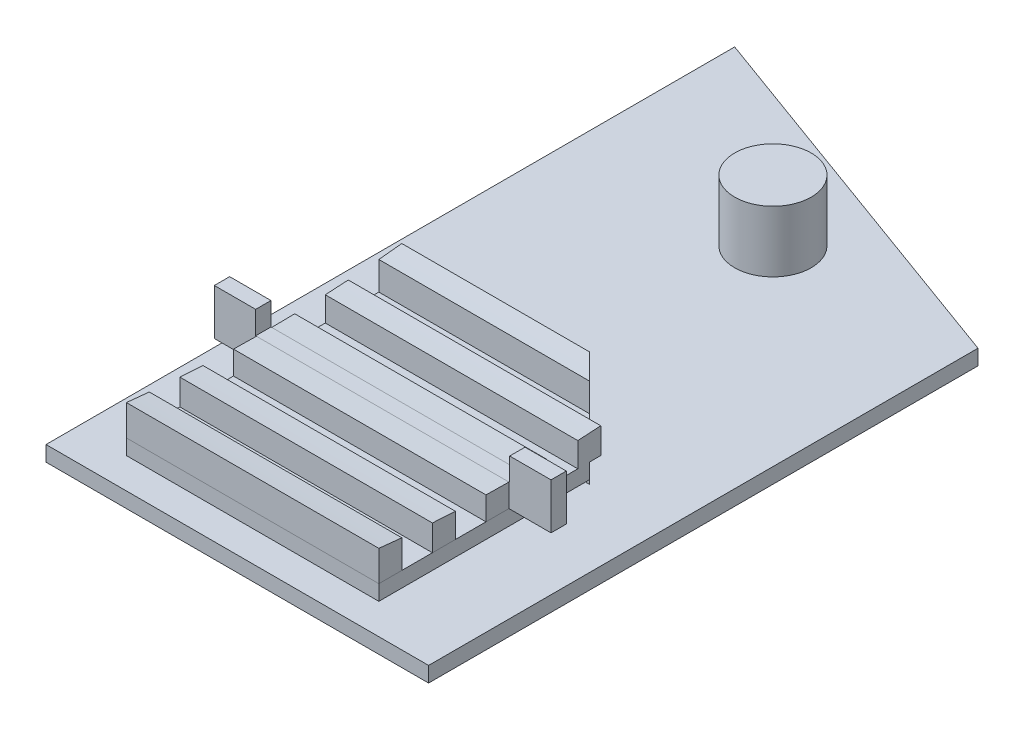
ISO-10303-21;
HEADER;
FILE_DESCRIPTION(('STEP AP214'),'2;1');
FILE_NAME('part.step','',(''),(''),'','','');
FILE_SCHEMA(('AUTOMOTIVE_DESIGN { 1 0 10303 214 1 1 1 1 }'));
ENDSEC;
DATA;
#1=APPLICATION_CONTEXT('core data for automotive mechanical design processes');
#2=APPLICATION_PROTOCOL_DEFINITION('international standard','automotive_design',2000,#1);
#3=PRODUCT_CONTEXT('',#1,'mechanical');
#4=PRODUCT('Part','Part','',(#3));
#5=PRODUCT_RELATED_PRODUCT_CATEGORY('part','',(#4));
#6=PRODUCT_DEFINITION_FORMATION('','',#4);
#7=PRODUCT_DEFINITION_CONTEXT('part definition',#1,'design');
#8=PRODUCT_DEFINITION('design','',#6,#7);
#9=PRODUCT_DEFINITION_SHAPE('','',#8);
#10=(LENGTH_UNIT() NAMED_UNIT(*) SI_UNIT(.MILLI.,.METRE.));
#11=(NAMED_UNIT(*) PLANE_ANGLE_UNIT() SI_UNIT($,.RADIAN.));
#12=(NAMED_UNIT(*) SI_UNIT($,.STERADIAN.) SOLID_ANGLE_UNIT());
#13=UNCERTAINTY_MEASURE_WITH_UNIT(LENGTH_MEASURE(1.E-05),#10,'distance_accuracy_value','');
#14=(GEOMETRIC_REPRESENTATION_CONTEXT(3) GLOBAL_UNCERTAINTY_ASSIGNED_CONTEXT((#13)) GLOBAL_UNIT_ASSIGNED_CONTEXT((#10,
#11,#12)) REPRESENTATION_CONTEXT('',''));
#15=CARTESIAN_POINT('',(0.,0.,0.));
#16=DIRECTION('',(0.,0.,1.));
#17=DIRECTION('',(1.,0.,0.));
#18=AXIS2_PLACEMENT_3D('',#15,#16,#17);
#19=CARTESIAN_POINT('',(0.,5.,0.));
#20=DIRECTION('',(0.,1.,0.));
#21=DIRECTION('',(0.,0.,1.));
#22=AXIS2_PLACEMENT_3D('',#19,#20,#21);
#23=PLANE('',#22);
#24=DIRECTION('',(-1.,0.,0.));
#25=VECTOR('',#24,1.);
#26=CARTESIAN_POINT('',(0.,5.,-9.5));
#27=LINE('',#26,#25);
#28=CARTESIAN_POINT('',(-8.3,5.,-9.50000000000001));
#29=VERTEX_POINT('',#28);
#30=CARTESIAN_POINT('',(-11.,5.,-9.50000000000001));
#31=VERTEX_POINT('',#30);
#32=EDGE_CURVE('E74',#29,#31,#27,.T.);
#33=ORIENTED_EDGE('',*,*,#32,.F.);
#34=DIRECTION('',(0.,0.,-1.));
#35=VECTOR('',#34,1.);
#36=CARTESIAN_POINT('',(-8.3,5.,0.));
#37=LINE('',#36,#35);
#38=CARTESIAN_POINT('',(-8.3,5.,-10.5));
#39=VERTEX_POINT('',#38);
#40=EDGE_CURVE('E125',#29,#39,#37,.T.);
#41=ORIENTED_EDGE('',*,*,#40,.T.);
#42=DIRECTION('',(1.,0.,0.));
#43=VECTOR('',#42,1.);
#44=CARTESIAN_POINT('',(0.,5.,-10.5));
#45=LINE('',#44,#43);
#46=CARTESIAN_POINT('',(-11.,5.,-10.5));
#47=VERTEX_POINT('',#46);
#48=EDGE_CURVE('E152',#47,#39,#45,.T.);
#49=ORIENTED_EDGE('',*,*,#48,.F.);
#50=DIRECTION('',(0.,0.,1.));
#51=VECTOR('',#50,1.);
#52=CARTESIAN_POINT('',(-11.,5.,0.));
#53=LINE('',#52,#51);
#54=EDGE_CURVE('E155',#47,#31,#53,.T.);
#55=ORIENTED_EDGE('',*,*,#54,.T.);
#56=EDGE_LOOP('',(#33,#41,#49,#55));
#57=FACE_BOUND('',#56,.T.);
#58=ADVANCED_FACE('F50',(#57),#23,.T.);
#59=CARTESIAN_POINT('',(0.,5.,-9.5));
#60=DIRECTION('',(0.,0.,1.));
#61=DIRECTION('',(1.,0.,0.));
#62=AXIS2_PLACEMENT_3D('',#59,#60,#61);
#63=PLANE('',#62);
#64=DIRECTION('',(0.,1.,0.));
#65=VECTOR('',#64,1.);
#66=CARTESIAN_POINT('',(8.3,5.,-9.5));
#67=LINE('',#66,#65);
#68=CARTESIAN_POINT('',(8.3,3.50154320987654,-9.5));
#69=VERTEX_POINT('',#68);
#70=CARTESIAN_POINT('',(8.3,5.,-9.50000000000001));
#71=VERTEX_POINT('',#70);
#72=EDGE_CURVE('E137',#69,#71,#67,.T.);
#73=ORIENTED_EDGE('',*,*,#72,.F.);
#74=DIRECTION('',(-1.,0.,0.));
#75=VECTOR('',#74,1.);
#76=CARTESIAN_POINT('',(8.3,3.50154320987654,-9.5));
#77=LINE('',#76,#75);
#78=CARTESIAN_POINT('',(-8.3,3.50154320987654,-9.5));
#79=VERTEX_POINT('',#78);
#80=EDGE_CURVE('E132',#69,#79,#77,.T.);
#81=ORIENTED_EDGE('',*,*,#80,.T.);
#82=DIRECTION('',(0.,1.,0.));
#83=VECTOR('',#82,1.);
#84=CARTESIAN_POINT('',(-8.3,5.,-9.5));
#85=LINE('',#84,#83);
#86=EDGE_CURVE('E121',#79,#29,#85,.T.);
#87=ORIENTED_EDGE('',*,*,#86,.T.);
#88=ORIENTED_EDGE('',*,*,#32,.T.);
#89=DIRECTION('',(0.,-1.,0.));
#90=VECTOR('',#89,1.);
#91=CARTESIAN_POINT('',(-11.,5.,-9.50000000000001));
#92=LINE('',#91,#90);
#93=CARTESIAN_POINT('',(-11.,2.,-9.50000000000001));
#94=VERTEX_POINT('',#93);
#95=EDGE_CURVE('E94',#31,#94,#92,.T.);
#96=ORIENTED_EDGE('',*,*,#95,.T.);
#97=DIRECTION('',(-1.,0.,0.));
#98=VECTOR('',#97,1.);
#99=CARTESIAN_POINT('',(0.,2.,-9.5));
#100=LINE('',#99,#98);
#101=CARTESIAN_POINT('',(11.,2.,-9.50000000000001));
#102=VERTEX_POINT('',#101);
#103=EDGE_CURVE('E138',#102,#94,#100,.T.);
#104=ORIENTED_EDGE('',*,*,#103,.F.);
#105=DIRECTION('',(0.,-1.,0.));
#106=VECTOR('',#105,1.);
#107=CARTESIAN_POINT('',(11.,5.,-9.50000000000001));
#108=LINE('',#107,#106);
#109=CARTESIAN_POINT('',(11.,5.,-9.50000000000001));
#110=VERTEX_POINT('',#109);
#111=EDGE_CURVE('E99',#110,#102,#108,.T.);
#112=ORIENTED_EDGE('',*,*,#111,.F.);
#113=EDGE_CURVE('E146',#110,#71,#27,.T.);
#114=ORIENTED_EDGE('',*,*,#113,.T.);
#115=EDGE_LOOP('',(#73,#81,#87,#88,#96,#104,#112,#114));
#116=FACE_BOUND('',#115,.T.);
#117=ADVANCED_FACE('F52',(#116),#63,.T.);
#118=CARTESIAN_POINT('',(11.,5.,0.));
#119=DIRECTION('',(1.,0.,0.));
#120=DIRECTION('',(0.,0.,-1.));
#121=AXIS2_PLACEMENT_3D('',#118,#119,#120);
#122=PLANE('',#121);
#123=DIRECTION('',(0.,0.,1.));
#124=VECTOR('',#123,1.);
#125=CARTESIAN_POINT('',(11.,2.,0.));
#126=LINE('',#125,#124);
#127=CARTESIAN_POINT('',(11.,2.,-10.5));
#128=VERTEX_POINT('',#127);
#129=EDGE_CURVE('E141',#128,#102,#126,.T.);
#130=ORIENTED_EDGE('',*,*,#129,.F.);
#131=DIRECTION('',(0.,-1.,0.));
#132=VECTOR('',#131,1.);
#133=CARTESIAN_POINT('',(11.,5.,-10.5));
#134=LINE('',#133,#132);
#135=CARTESIAN_POINT('',(11.,5.,-10.5));
#136=VERTEX_POINT('',#135);
#137=EDGE_CURVE('E167',#136,#128,#134,.T.);
#138=ORIENTED_EDGE('',*,*,#137,.F.);
#139=DIRECTION('',(0.,0.,1.));
#140=VECTOR('',#139,1.);
#141=CARTESIAN_POINT('',(11.,5.,0.));
#142=LINE('',#141,#140);
#143=EDGE_CURVE('E148',#136,#110,#142,.T.);
#144=ORIENTED_EDGE('',*,*,#143,.T.);
#145=ORIENTED_EDGE('',*,*,#111,.T.);
#146=EDGE_LOOP('',(#130,#138,#144,#145));
#147=FACE_BOUND('',#146,.T.);
#148=ADVANCED_FACE('F183',(#147),#122,.T.);
#149=CARTESIAN_POINT('',(0.,5.,-10.5));
#150=DIRECTION('',(0.,0.,-1.));
#151=DIRECTION('',(-1.,0.,0.));
#152=AXIS2_PLACEMENT_3D('',#149,#150,#151);
#153=PLANE('',#152);
#154=DIRECTION('',(0.,-1.,0.));
#155=VECTOR('',#154,1.);
#156=CARTESIAN_POINT('',(8.3,5.,-10.5));
#157=LINE('',#156,#155);
#158=CARTESIAN_POINT('',(8.3,5.,-10.5));
#159=VERTEX_POINT('',#158);
#160=CARTESIAN_POINT('',(8.3,3.50154320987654,-10.5));
#161=VERTEX_POINT('',#160);
#162=EDGE_CURVE('E127',#159,#161,#157,.T.);
#163=ORIENTED_EDGE('',*,*,#162,.F.);
#164=EDGE_CURVE('E151',#159,#136,#45,.T.);
#165=ORIENTED_EDGE('',*,*,#164,.T.);
#166=ORIENTED_EDGE('',*,*,#137,.T.);
#167=DIRECTION('',(1.,0.,0.));
#168=VECTOR('',#167,1.);
#169=CARTESIAN_POINT('',(0.,2.,-10.5));
#170=LINE('',#169,#168);
#171=CARTESIAN_POINT('',(-11.,2.,-10.5));
#172=VERTEX_POINT('',#171);
#173=EDGE_CURVE('E159',#172,#128,#170,.T.);
#174=ORIENTED_EDGE('',*,*,#173,.F.);
#175=DIRECTION('',(0.,-1.,0.));
#176=VECTOR('',#175,1.);
#177=CARTESIAN_POINT('',(-11.,5.,-10.5));
#178=LINE('',#177,#176);
#179=EDGE_CURVE('E165',#47,#172,#178,.T.);
#180=ORIENTED_EDGE('',*,*,#179,.F.);
#181=ORIENTED_EDGE('',*,*,#48,.T.);
#182=DIRECTION('',(0.,-1.,0.));
#183=VECTOR('',#182,1.);
#184=CARTESIAN_POINT('',(-8.3,5.,-10.5));
#185=LINE('',#184,#183);
#186=CARTESIAN_POINT('',(-8.3,3.50154320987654,-10.5));
#187=VERTEX_POINT('',#186);
#188=EDGE_CURVE('E65',#39,#187,#185,.T.);
#189=ORIENTED_EDGE('',*,*,#188,.T.);
#190=DIRECTION('',(-1.,0.,0.));
#191=VECTOR('',#190,1.);
#192=CARTESIAN_POINT('',(8.3,3.50154320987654,-10.5));
#193=LINE('',#192,#191);
#194=EDGE_CURVE('E12',#187,#161,#193,.F.);
#195=ORIENTED_EDGE('',*,*,#194,.T.);
#196=EDGE_LOOP('',(#163,#165,#166,#174,#180,#181,#189,#195));
#197=FACE_BOUND('',#196,.T.);
#198=ADVANCED_FACE('F177',(#197),#153,.T.);
#199=CARTESIAN_POINT('',(-11.,5.,0.));
#200=DIRECTION('',(1.,0.,0.));
#201=DIRECTION('',(0.,0.,-1.));
#202=AXIS2_PLACEMENT_3D('',#199,#200,#201);
#203=PLANE('',#202);
#204=DIRECTION('',(0.,0.,1.));
#205=VECTOR('',#204,1.);
#206=CARTESIAN_POINT('',(-11.,2.,0.));
#207=LINE('',#206,#205);
#208=EDGE_CURVE('E162',#172,#94,#207,.T.);
#209=ORIENTED_EDGE('',*,*,#208,.T.);
#210=ORIENTED_EDGE('',*,*,#95,.F.);
#211=ORIENTED_EDGE('',*,*,#54,.F.);
#212=ORIENTED_EDGE('',*,*,#179,.T.);
#213=EDGE_LOOP('',(#209,#210,#211,#212));
#214=FACE_BOUND('',#213,.T.);
#215=ADVANCED_FACE('F190',(#214),#203,.F.);
#216=DIRECTION('',(0.,0.,-1.));
#217=VECTOR('',#216,1.);
#218=CARTESIAN_POINT('',(8.3,5.,0.));
#219=LINE('',#218,#217);
#220=EDGE_CURVE('E58',#71,#159,#219,.T.);
#221=ORIENTED_EDGE('',*,*,#220,.F.);
#222=ORIENTED_EDGE('',*,*,#113,.F.);
#223=ORIENTED_EDGE('',*,*,#143,.F.);
#224=ORIENTED_EDGE('',*,*,#164,.F.);
#225=EDGE_LOOP('',(#221,#222,#223,#224));
#226=FACE_BOUND('',#225,.T.);
#227=ADVANCED_FACE('F180',(#226),#23,.T.);
#228=CARTESIAN_POINT('',(0.,2.,0.));
#229=DIRECTION('',(0.,1.,0.));
#230=DIRECTION('',(0.,0.,1.));
#231=AXIS2_PLACEMENT_3D('',#228,#229,#230);
#232=PLANE('',#231);
#233=ORIENTED_EDGE('',*,*,#103,.T.);
#234=ORIENTED_EDGE('',*,*,#208,.F.);
#235=ORIENTED_EDGE('',*,*,#173,.T.);
#236=ORIENTED_EDGE('',*,*,#129,.T.);
#237=EDGE_LOOP('',(#233,#234,#235,#236));
#238=FACE_BOUND('',#237,.T.);
#239=ADVANCED_FACE('F188',(#238),#232,.F.);
#240=CARTESIAN_POINT('',(8.3,4.,-1.));
#241=CARTESIAN_POINT('',(8.3,3.,-10.));
#242=CARTESIAN_POINT('',(8.3,4.,-19.));
#243=B_SPLINE_CURVE_WITH_KNOTS('',2,(#240,#241,#242),.UNSPECIFIED.,.F.,.F.,(3,3),(0.,1.),.UNSPECIFIED.);
#244=DIRECTION('',(-1.,0.,0.));
#245=VECTOR('',#244,1.);
#246=SURFACE_OF_LINEAR_EXTRUSION('',#243,#245);
#247=EDGE_CURVE('E134',#69,#161,#243,.T.);
#248=ORIENTED_EDGE('',*,*,#247,.T.);
#249=ORIENTED_EDGE('',*,*,#194,.F.);
#250=CARTESIAN_POINT('',(-8.3,4.,-1.));
#251=CARTESIAN_POINT('',(-8.3,3.,-10.));
#252=CARTESIAN_POINT('',(-8.3,4.,-19.));
#253=B_SPLINE_CURVE_WITH_KNOTS('',2,(#250,#251,#252),.UNSPECIFIED.,.F.,.F.,(3,3),(0.,1.),.UNSPECIFIED.);
#254=EDGE_CURVE('E124',#79,#187,#253,.T.);
#255=ORIENTED_EDGE('',*,*,#254,.F.);
#256=ORIENTED_EDGE('',*,*,#80,.F.);
#257=EDGE_LOOP('',(#248,#249,#255,#256));
#258=FACE_BOUND('',#257,.T.);
#259=ADVANCED_FACE('F131',(#258),#246,.T.);
#260=CARTESIAN_POINT('',(8.3,0.,0.));
#261=DIRECTION('',(1.,0.,0.));
#262=DIRECTION('',(0.,0.,-1.));
#263=AXIS2_PLACEMENT_3D('',#260,#261,#262);
#264=PLANE('',#263);
#265=ORIENTED_EDGE('',*,*,#72,.T.);
#266=ORIENTED_EDGE('',*,*,#220,.T.);
#267=ORIENTED_EDGE('',*,*,#162,.T.);
#268=ORIENTED_EDGE('',*,*,#247,.F.);
#269=EDGE_LOOP('',(#265,#266,#267,#268));
#270=FACE_BOUND('',#269,.T.);
#271=ADVANCED_FACE('F173',(#270),#264,.F.);
#272=CARTESIAN_POINT('',(-8.3,0.,0.));
#273=DIRECTION('',(1.,0.,0.));
#274=DIRECTION('',(0.,0.,-1.));
#275=AXIS2_PLACEMENT_3D('',#272,#273,#274);
#276=PLANE('',#275);
#277=ORIENTED_EDGE('',*,*,#254,.T.);
#278=ORIENTED_EDGE('',*,*,#188,.F.);
#279=ORIENTED_EDGE('',*,*,#40,.F.);
#280=ORIENTED_EDGE('',*,*,#86,.F.);
#281=EDGE_LOOP('',(#277,#278,#279,#280));
#282=FACE_BOUND('',#281,.T.);
#283=ADVANCED_FACE('F123',(#282),#276,.T.);
#284=CLOSED_SHELL('',(#58,#117,#148,#198,#215,#227,#239,#259,#271,#283));
#285=MANIFOLD_SOLID_BREP('B2',#284);
#286=CARTESIAN_POINT('',(0.,4.,-2.5));
#287=DIRECTION('',(0.,0.,-1.));
#288=DIRECTION('',(-1.,0.,0.));
#289=AXIS2_PLACEMENT_3D('',#286,#287,#288);
#290=PLANE('',#289);
#291=DIRECTION('',(-1.,0.,0.));
#292=VECTOR('',#291,1.);
#293=CARTESIAN_POINT('',(12.5,3.84722222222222,-2.5));
#294=LINE('',#293,#292);
#295=CARTESIAN_POINT('',(8.25,3.84722222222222,-2.5));
#296=VERTEX_POINT('',#295);
#297=CARTESIAN_POINT('',(-8.25,3.84722222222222,-2.5));
#298=VERTEX_POINT('',#297);
#299=EDGE_CURVE('E403',#296,#298,#294,.T.);
#300=ORIENTED_EDGE('',*,*,#299,.F.);
#301=DIRECTION('',(0.,-1.,0.));
#302=VECTOR('',#301,1.);
#303=CARTESIAN_POINT('',(8.25,4.,-2.5));
#304=LINE('',#303,#302);
#305=CARTESIAN_POINT('',(8.25,2.,-2.5));
#306=VERTEX_POINT('',#305);
#307=EDGE_CURVE('E378',#296,#306,#304,.T.);
#308=ORIENTED_EDGE('',*,*,#307,.T.);
#309=DIRECTION('',(1.,0.,0.));
#310=VECTOR('',#309,1.);
#311=CARTESIAN_POINT('',(0.,2.,-2.5));
#312=LINE('',#311,#310);
#313=CARTESIAN_POINT('',(-8.25,2.,-2.5));
#314=VERTEX_POINT('',#313);
#315=EDGE_CURVE('E385',#314,#306,#312,.T.);
#316=ORIENTED_EDGE('',*,*,#315,.F.);
#317=DIRECTION('',(0.,-1.,0.));
#318=VECTOR('',#317,1.);
#319=CARTESIAN_POINT('',(-8.25,4.,-2.5));
#320=LINE('',#319,#318);
#321=EDGE_CURVE('E48',#298,#314,#320,.T.);
#322=ORIENTED_EDGE('',*,*,#321,.F.);
#323=EDGE_LOOP('',(#300,#308,#316,#322));
#324=FACE_BOUND('',#323,.T.);
#325=ADVANCED_FACE('F332',(#324),#290,.T.);
#326=CARTESIAN_POINT('',(-8.25,4.,0.));
#327=DIRECTION('',(-1.,0.,0.));
#328=DIRECTION('',(0.,0.,1.));
#329=AXIS2_PLACEMENT_3D('',#326,#327,#328);
#330=PLANE('',#329);
#331=CARTESIAN_POINT('',(-8.25,4.,-19.));
#332=CARTESIAN_POINT('',(-8.25,3.,-10.));
#333=CARTESIAN_POINT('',(-8.25,4.,-1.));
#334=B_SPLINE_CURVE_WITH_KNOTS('',2,(#331,#332,#333),.UNSPECIFIED.,.F.,.F.,(3,3),(0.,1.),.UNSPECIFIED.);
#335=CARTESIAN_POINT('',(-8.25,4.,-1.));
#336=VERTEX_POINT('',#335);
#337=EDGE_CURVE('E349',#298,#336,#334,.T.);
#338=ORIENTED_EDGE('',*,*,#337,.F.);
#339=ORIENTED_EDGE('',*,*,#321,.T.);
#340=DIRECTION('',(0.,0.,-1.));
#341=VECTOR('',#340,1.);
#342=CARTESIAN_POINT('',(-8.25,2.,0.));
#343=LINE('',#342,#341);
#344=CARTESIAN_POINT('',(-8.25,2.,-1.));
#345=VERTEX_POINT('',#344);
#346=EDGE_CURVE('E390',#345,#314,#343,.T.);
#347=ORIENTED_EDGE('',*,*,#346,.F.);
#348=DIRECTION('',(0.,-1.,0.));
#349=VECTOR('',#348,1.);
#350=CARTESIAN_POINT('',(-8.25,4.,-1.));
#351=LINE('',#350,#349);
#352=EDGE_CURVE('E341',#336,#345,#351,.T.);
#353=ORIENTED_EDGE('',*,*,#352,.F.);
#354=EDGE_LOOP('',(#338,#339,#347,#353));
#355=FACE_BOUND('',#354,.T.);
#356=ADVANCED_FACE('F408',(#355),#330,.T.);
#357=CARTESIAN_POINT('',(0.,4.,-1.));
#358=DIRECTION('',(0.,0.,1.));
#359=DIRECTION('',(1.,0.,0.));
#360=AXIS2_PLACEMENT_3D('',#357,#358,#359);
#361=PLANE('',#360);
#362=DIRECTION('',(-1.,0.,0.));
#363=VECTOR('',#362,1.);
#364=CARTESIAN_POINT('',(0.,2.,-1.));
#365=LINE('',#364,#363);
#366=CARTESIAN_POINT('',(8.25,2.,-1.));
#367=VERTEX_POINT('',#366);
#368=EDGE_CURVE('E383',#367,#345,#365,.T.);
#369=ORIENTED_EDGE('',*,*,#368,.F.);
#370=DIRECTION('',(0.,-1.,0.));
#371=VECTOR('',#370,1.);
#372=CARTESIAN_POINT('',(8.25,4.,-1.));
#373=LINE('',#372,#371);
#374=CARTESIAN_POINT('',(8.25,4.,-1.));
#375=VERTEX_POINT('',#374);
#376=EDGE_CURVE('E366',#375,#367,#373,.T.);
#377=ORIENTED_EDGE('',*,*,#376,.F.);
#378=DIRECTION('',(-1.,0.,0.));
#379=VECTOR('',#378,1.);
#380=CARTESIAN_POINT('',(0.,4.,-1.));
#381=LINE('',#380,#379);
#382=EDGE_CURVE('E386',#375,#336,#381,.T.);
#383=ORIENTED_EDGE('',*,*,#382,.T.);
#384=ORIENTED_EDGE('',*,*,#352,.T.);
#385=EDGE_LOOP('',(#369,#377,#383,#384));
#386=FACE_BOUND('',#385,.T.);
#387=ADVANCED_FACE('F388',(#386),#361,.T.);
#388=CARTESIAN_POINT('',(8.25,4.,0.));
#389=DIRECTION('',(-1.,0.,0.));
#390=DIRECTION('',(0.,0.,1.));
#391=AXIS2_PLACEMENT_3D('',#388,#389,#390);
#392=PLANE('',#391);
#393=ORIENTED_EDGE('',*,*,#307,.F.);
#394=CARTESIAN_POINT('',(8.25,4.,-19.));
#395=CARTESIAN_POINT('',(8.25,3.,-10.));
#396=CARTESIAN_POINT('',(8.25,4.,-1.));
#397=B_SPLINE_CURVE_WITH_KNOTS('',2,(#394,#395,#396),.UNSPECIFIED.,.F.,.F.,(3,3),(0.,1.),.UNSPECIFIED.);
#398=EDGE_CURVE('E374',#296,#375,#397,.T.);
#399=ORIENTED_EDGE('',*,*,#398,.T.);
#400=ORIENTED_EDGE('',*,*,#376,.T.);
#401=DIRECTION('',(0.,0.,-1.));
#402=VECTOR('',#401,1.);
#403=CARTESIAN_POINT('',(8.25,2.,0.));
#404=LINE('',#403,#402);
#405=EDGE_CURVE('E370',#367,#306,#404,.T.);
#406=ORIENTED_EDGE('',*,*,#405,.T.);
#407=EDGE_LOOP('',(#393,#399,#400,#406));
#408=FACE_BOUND('',#407,.T.);
#409=ADVANCED_FACE('F369',(#408),#392,.F.);
#410=CARTESIAN_POINT('',(0.,2.,0.));
#411=DIRECTION('',(0.,1.,0.));
#412=DIRECTION('',(0.,0.,1.));
#413=AXIS2_PLACEMENT_3D('',#410,#411,#412);
#414=PLANE('',#413);
#415=ORIENTED_EDGE('',*,*,#315,.T.);
#416=ORIENTED_EDGE('',*,*,#405,.F.);
#417=ORIENTED_EDGE('',*,*,#368,.T.);
#418=ORIENTED_EDGE('',*,*,#346,.T.);
#419=EDGE_LOOP('',(#415,#416,#417,#418));
#420=FACE_BOUND('',#419,.T.);
#421=ADVANCED_FACE('F381',(#420),#414,.F.);
#422=CARTESIAN_POINT('',(12.5,4.,-19.));
#423=CARTESIAN_POINT('',(12.5,3.,-10.));
#424=CARTESIAN_POINT('',(12.5,4.,-1.));
#425=B_SPLINE_CURVE_WITH_KNOTS('',2,(#422,#423,#424),.UNSPECIFIED.,.F.,.F.,(3,3),(0.,1.),.UNSPECIFIED.);
#426=DIRECTION('',(-1.,0.,0.));
#427=VECTOR('',#426,1.);
#428=SURFACE_OF_LINEAR_EXTRUSION('',#425,#427);
#429=ORIENTED_EDGE('',*,*,#299,.T.);
#430=ORIENTED_EDGE('',*,*,#337,.T.);
#431=ORIENTED_EDGE('',*,*,#382,.F.);
#432=ORIENTED_EDGE('',*,*,#398,.F.);
#433=EDGE_LOOP('',(#429,#430,#431,#432));
#434=FACE_BOUND('',#433,.T.);
#435=ADVANCED_FACE('F399',(#434),#428,.F.);
#436=CLOSED_SHELL('',(#325,#356,#387,#409,#421,#435));
#437=MANIFOLD_SOLID_BREP('B6',#436);
#438=CARTESIAN_POINT('',(0.,4.,-6.));
#439=DIRECTION('',(0.,0.,-1.));
#440=DIRECTION('',(-1.,0.,0.));
#441=AXIS2_PLACEMENT_3D('',#438,#439,#440);
#442=PLANE('',#441);
#443=DIRECTION('',(-1.,0.,0.));
#444=VECTOR('',#443,1.);
#445=CARTESIAN_POINT('',(12.5,3.59876543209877,-6.));
#446=LINE('',#445,#444);
#447=CARTESIAN_POINT('',(8.25,3.59876543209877,-6.));
#448=VERTEX_POINT('',#447);
#449=CARTESIAN_POINT('',(-8.25,3.59876543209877,-6.));
#450=VERTEX_POINT('',#449);
#451=EDGE_CURVE('E529',#448,#450,#446,.T.);
#452=ORIENTED_EDGE('',*,*,#451,.F.);
#453=DIRECTION('',(0.,-1.,0.));
#454=VECTOR('',#453,1.);
#455=CARTESIAN_POINT('',(8.25,4.,-6.));
#456=LINE('',#455,#454);
#457=CARTESIAN_POINT('',(8.25,2.,-6.));
#458=VERTEX_POINT('',#457);
#459=EDGE_CURVE('E512',#448,#458,#456,.T.);
#460=ORIENTED_EDGE('',*,*,#459,.T.);
#461=DIRECTION('',(1.,0.,0.));
#462=VECTOR('',#461,1.);
#463=CARTESIAN_POINT('',(0.,2.,-6.));
#464=LINE('',#463,#462);
#465=CARTESIAN_POINT('',(-8.25,2.,-6.));
#466=VERTEX_POINT('',#465);
#467=EDGE_CURVE('E534',#466,#458,#464,.T.);
#468=ORIENTED_EDGE('',*,*,#467,.F.);
#469=DIRECTION('',(0.,-1.,0.));
#470=VECTOR('',#469,1.);
#471=CARTESIAN_POINT('',(-8.25,4.,-6.));
#472=LINE('',#471,#470);
#473=EDGE_CURVE('E498',#450,#466,#472,.T.);
#474=ORIENTED_EDGE('',*,*,#473,.F.);
#475=EDGE_LOOP('',(#452,#460,#468,#474));
#476=FACE_BOUND('',#475,.T.);
#477=ADVANCED_FACE('F489',(#476),#442,.T.);
#478=CARTESIAN_POINT('',(-8.25,4.,0.));
#479=DIRECTION('',(-1.,0.,0.));
#480=DIRECTION('',(0.,0.,1.));
#481=AXIS2_PLACEMENT_3D('',#478,#479,#480);
#482=PLANE('',#481);
#483=CARTESIAN_POINT('',(-8.25,4.,-19.));
#484=CARTESIAN_POINT('',(-8.25,3.,-10.));
#485=CARTESIAN_POINT('',(-8.25,4.,-1.));
#486=B_SPLINE_CURVE_WITH_KNOTS('',2,(#483,#484,#485),.UNSPECIFIED.,.F.,.F.,(3,3),(0.,1.),.UNSPECIFIED.);
#487=CARTESIAN_POINT('',(-8.25,3.68672839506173,-4.5));
#488=VERTEX_POINT('',#487);
#489=EDGE_CURVE('E532',#450,#488,#486,.T.);
#490=ORIENTED_EDGE('',*,*,#489,.F.);
#491=ORIENTED_EDGE('',*,*,#473,.T.);
#492=DIRECTION('',(0.,0.,-1.));
#493=VECTOR('',#492,1.);
#494=CARTESIAN_POINT('',(-8.25,2.,0.));
#495=LINE('',#494,#493);
#496=CARTESIAN_POINT('',(-8.25,2.,-4.5));
#497=VERTEX_POINT('',#496);
#498=EDGE_CURVE('E554',#497,#466,#495,.T.);
#499=ORIENTED_EDGE('',*,*,#498,.F.);
#500=DIRECTION('',(0.,-1.,0.));
#501=VECTOR('',#500,1.);
#502=CARTESIAN_POINT('',(-8.25,4.,-4.5));
#503=LINE('',#502,#501);
#504=EDGE_CURVE('E540',#488,#497,#503,.T.);
#505=ORIENTED_EDGE('',*,*,#504,.F.);
#506=EDGE_LOOP('',(#490,#491,#499,#505));
#507=FACE_BOUND('',#506,.T.);
#508=ADVANCED_FACE('F538',(#507),#482,.T.);
#509=CARTESIAN_POINT('',(0.,4.,-4.5));
#510=DIRECTION('',(0.,0.,-1.));
#511=DIRECTION('',(-1.,0.,0.));
#512=AXIS2_PLACEMENT_3D('',#509,#510,#511);
#513=PLANE('',#512);
#514=DIRECTION('',(0.,-1.,0.));
#515=VECTOR('',#514,1.);
#516=CARTESIAN_POINT('',(8.25,4.,-4.5));
#517=LINE('',#516,#515);
#518=CARTESIAN_POINT('',(8.25,3.68672839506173,-4.5));
#519=VERTEX_POINT('',#518);
#520=CARTESIAN_POINT('',(8.25,2.,-4.5));
#521=VERTEX_POINT('',#520);
#522=EDGE_CURVE('E544',#519,#521,#517,.T.);
#523=ORIENTED_EDGE('',*,*,#522,.F.);
#524=DIRECTION('',(-1.,0.,0.));
#525=VECTOR('',#524,1.);
#526=CARTESIAN_POINT('',(12.5,3.68672839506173,-4.5));
#527=LINE('',#526,#525);
#528=EDGE_CURVE('E505',#519,#488,#527,.T.);
#529=ORIENTED_EDGE('',*,*,#528,.T.);
#530=ORIENTED_EDGE('',*,*,#504,.T.);
#531=DIRECTION('',(1.,0.,0.));
#532=VECTOR('',#531,1.);
#533=CARTESIAN_POINT('',(0.,2.,-4.5));
#534=LINE('',#533,#532);
#535=EDGE_CURVE('E551',#497,#521,#534,.T.);
#536=ORIENTED_EDGE('',*,*,#535,.T.);
#537=EDGE_LOOP('',(#523,#529,#530,#536));
#538=FACE_BOUND('',#537,.T.);
#539=ADVANCED_FACE('F579',(#538),#513,.F.);
#540=CARTESIAN_POINT('',(8.25,4.,0.));
#541=DIRECTION('',(-1.,0.,0.));
#542=DIRECTION('',(0.,0.,1.));
#543=AXIS2_PLACEMENT_3D('',#540,#541,#542);
#544=PLANE('',#543);
#545=ORIENTED_EDGE('',*,*,#459,.F.);
#546=CARTESIAN_POINT('',(8.25,4.,-19.));
#547=CARTESIAN_POINT('',(8.25,3.,-10.));
#548=CARTESIAN_POINT('',(8.25,4.,-1.));
#549=B_SPLINE_CURVE_WITH_KNOTS('',2,(#546,#547,#548),.UNSPECIFIED.,.F.,.F.,(3,3),(0.,1.),.UNSPECIFIED.);
#550=EDGE_CURVE('E330',#448,#519,#549,.T.);
#551=ORIENTED_EDGE('',*,*,#550,.T.);
#552=ORIENTED_EDGE('',*,*,#522,.T.);
#553=DIRECTION('',(0.,0.,-1.));
#554=VECTOR('',#553,1.);
#555=CARTESIAN_POINT('',(8.25,2.,0.));
#556=LINE('',#555,#554);
#557=EDGE_CURVE('E549',#521,#458,#556,.T.);
#558=ORIENTED_EDGE('',*,*,#557,.T.);
#559=EDGE_LOOP('',(#545,#551,#552,#558));
#560=FACE_BOUND('',#559,.T.);
#561=ADVANCED_FACE('F575',(#560),#544,.F.);
#562=CARTESIAN_POINT('',(0.,2.,0.));
#563=DIRECTION('',(0.,1.,0.));
#564=DIRECTION('',(0.,0.,1.));
#565=AXIS2_PLACEMENT_3D('',#562,#563,#564);
#566=PLANE('',#565);
#567=ORIENTED_EDGE('',*,*,#467,.T.);
#568=ORIENTED_EDGE('',*,*,#557,.F.);
#569=ORIENTED_EDGE('',*,*,#535,.F.);
#570=ORIENTED_EDGE('',*,*,#498,.T.);
#571=EDGE_LOOP('',(#567,#568,#569,#570));
#572=FACE_BOUND('',#571,.T.);
#573=ADVANCED_FACE('F572',(#572),#566,.F.);
#574=CARTESIAN_POINT('',(12.5,4.,-19.));
#575=CARTESIAN_POINT('',(12.5,3.,-10.));
#576=CARTESIAN_POINT('',(12.5,4.,-1.));
#577=B_SPLINE_CURVE_WITH_KNOTS('',2,(#574,#575,#576),.UNSPECIFIED.,.F.,.F.,(3,3),(0.,1.),.UNSPECIFIED.);
#578=DIRECTION('',(-1.,0.,0.));
#579=VECTOR('',#578,1.);
#580=SURFACE_OF_LINEAR_EXTRUSION('',#577,#579);
#581=ORIENTED_EDGE('',*,*,#451,.T.);
#582=ORIENTED_EDGE('',*,*,#489,.T.);
#583=ORIENTED_EDGE('',*,*,#528,.F.);
#584=ORIENTED_EDGE('',*,*,#550,.F.);
#585=EDGE_LOOP('',(#581,#582,#583,#584));
#586=FACE_BOUND('',#585,.T.);
#587=ADVANCED_FACE('F531',(#586),#580,.F.);
#588=CLOSED_SHELL('',(#477,#508,#539,#561,#573,#587));
#589=MANIFOLD_SOLID_BREP('B42',#588);
#590=CARTESIAN_POINT('',(8.25,4.,0.));
#591=DIRECTION('',(-1.,0.,0.));
#592=DIRECTION('',(0.,0.,1.));
#593=AXIS2_PLACEMENT_3D('',#590,#591,#592);
#594=PLANE('',#593);
#595=DIRECTION('',(0.,-1.,0.));
#596=VECTOR('',#595,1.);
#597=CARTESIAN_POINT('',(8.25,4.,-9.5));
#598=LINE('',#597,#596);
#599=CARTESIAN_POINT('',(8.25,3.50154320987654,-9.50000000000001));
#600=VERTEX_POINT('',#599);
#601=CARTESIAN_POINT('',(8.25,2.,-9.5));
#602=VERTEX_POINT('',#601);
#603=EDGE_CURVE('E647',#600,#602,#598,.T.);
#604=ORIENTED_EDGE('',*,*,#603,.F.);
#605=CARTESIAN_POINT('',(8.25,4.,-19.));
#606=CARTESIAN_POINT('',(8.25,3.,-10.));
#607=CARTESIAN_POINT('',(8.25,4.,-1.));
#608=B_SPLINE_CURVE_WITH_KNOTS('',2,(#605,#606,#607),.UNSPECIFIED.,.F.,.F.,(3,3),(0.,1.),.UNSPECIFIED.);
#609=CARTESIAN_POINT('',(8.25,3.52469135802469,-8.));
#610=VERTEX_POINT('',#609);
#611=EDGE_CURVE('E681',#600,#610,#608,.T.);
#612=ORIENTED_EDGE('',*,*,#611,.T.);
#613=DIRECTION('',(0.,-1.,0.));
#614=VECTOR('',#613,1.);
#615=CARTESIAN_POINT('',(8.25,4.,-8.));
#616=LINE('',#615,#614);
#617=CARTESIAN_POINT('',(8.25,2.,-8.));
#618=VERTEX_POINT('',#617);
#619=EDGE_CURVE('E661',#610,#618,#616,.T.);
#620=ORIENTED_EDGE('',*,*,#619,.T.);
#621=DIRECTION('',(0.,0.,-1.));
#622=VECTOR('',#621,1.);
#623=CARTESIAN_POINT('',(8.25,2.,0.));
#624=LINE('',#623,#622);
#625=EDGE_CURVE('E685',#618,#602,#624,.T.);
#626=ORIENTED_EDGE('',*,*,#625,.T.);
#627=EDGE_LOOP('',(#604,#612,#620,#626));
#628=FACE_BOUND('',#627,.T.);
#629=ADVANCED_FACE('F640',(#628),#594,.F.);
#630=CARTESIAN_POINT('',(0.,4.,-9.5));
#631=DIRECTION('',(0.,0.,1.));
#632=DIRECTION('',(1.,0.,0.));
#633=AXIS2_PLACEMENT_3D('',#630,#631,#632);
#634=PLANE('',#633);
#635=DIRECTION('',(0.,-1.,0.));
#636=VECTOR('',#635,1.);
#637=CARTESIAN_POINT('',(-8.25,4.,-9.5));
#638=LINE('',#637,#636);
#639=CARTESIAN_POINT('',(-8.25,3.50154320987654,-9.49999999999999));
#640=VERTEX_POINT('',#639);
#641=CARTESIAN_POINT('',(-8.25,2.,-9.5));
#642=VERTEX_POINT('',#641);
#643=EDGE_CURVE('E691',#640,#642,#638,.T.);
#644=ORIENTED_EDGE('',*,*,#643,.F.);
#645=DIRECTION('',(-1.,0.,0.));
#646=VECTOR('',#645,1.);
#647=CARTESIAN_POINT('',(12.5,3.50154320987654,-9.5));
#648=LINE('',#647,#646);
#649=EDGE_CURVE('E679',#640,#600,#648,.F.);
#650=ORIENTED_EDGE('',*,*,#649,.T.);
#651=ORIENTED_EDGE('',*,*,#603,.T.);
#652=DIRECTION('',(-1.,0.,0.));
#653=VECTOR('',#652,1.);
#654=CARTESIAN_POINT('',(0.,2.,-9.5));
#655=LINE('',#654,#653);
#656=EDGE_CURVE('E697',#602,#642,#655,.T.);
#657=ORIENTED_EDGE('',*,*,#656,.T.);
#658=EDGE_LOOP('',(#644,#650,#651,#657));
#659=FACE_BOUND('',#658,.T.);
#660=ADVANCED_FACE('F695',(#659),#634,.F.);
#661=CARTESIAN_POINT('',(-8.25,4.,0.));
#662=DIRECTION('',(-1.,0.,0.));
#663=DIRECTION('',(0.,0.,1.));
#664=AXIS2_PLACEMENT_3D('',#661,#662,#663);
#665=PLANE('',#664);
#666=CARTESIAN_POINT('',(-8.25,4.,-19.));
#667=CARTESIAN_POINT('',(-8.25,3.,-10.));
#668=CARTESIAN_POINT('',(-8.25,4.,-1.));
#669=B_SPLINE_CURVE_WITH_KNOTS('',2,(#666,#667,#668),.UNSPECIFIED.,.F.,.F.,(3,3),(0.,1.),.UNSPECIFIED.);
#670=CARTESIAN_POINT('',(-8.25,3.52469135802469,-8.));
#671=VERTEX_POINT('',#670);
#672=EDGE_CURVE('E654',#640,#671,#669,.T.);
#673=ORIENTED_EDGE('',*,*,#672,.F.);
#674=ORIENTED_EDGE('',*,*,#643,.T.);
#675=DIRECTION('',(0.,0.,-1.));
#676=VECTOR('',#675,1.);
#677=CARTESIAN_POINT('',(-8.25,2.,0.));
#678=LINE('',#677,#676);
#679=CARTESIAN_POINT('',(-8.25,2.,-8.));
#680=VERTEX_POINT('',#679);
#681=EDGE_CURVE('E705',#680,#642,#678,.T.);
#682=ORIENTED_EDGE('',*,*,#681,.F.);
#683=DIRECTION('',(0.,-1.,0.));
#684=VECTOR('',#683,1.);
#685=CARTESIAN_POINT('',(-8.25,4.,-8.));
#686=LINE('',#685,#684);
#687=EDGE_CURVE('E693',#671,#680,#686,.T.);
#688=ORIENTED_EDGE('',*,*,#687,.F.);
#689=EDGE_LOOP('',(#673,#674,#682,#688));
#690=FACE_BOUND('',#689,.T.);
#691=ADVANCED_FACE('F689',(#690),#665,.T.);
#692=CARTESIAN_POINT('',(0.,4.,-8.));
#693=DIRECTION('',(0.,0.,-1.));
#694=DIRECTION('',(-1.,0.,0.));
#695=AXIS2_PLACEMENT_3D('',#692,#693,#694);
#696=PLANE('',#695);
#697=ORIENTED_EDGE('',*,*,#619,.F.);
#698=DIRECTION('',(-1.,0.,0.));
#699=VECTOR('',#698,1.);
#700=CARTESIAN_POINT('',(12.5,3.52469135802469,-8.));
#701=LINE('',#700,#699);
#702=EDGE_CURVE('E487',#610,#671,#701,.T.);
#703=ORIENTED_EDGE('',*,*,#702,.T.);
#704=ORIENTED_EDGE('',*,*,#687,.T.);
#705=DIRECTION('',(1.,0.,0.));
#706=VECTOR('',#705,1.);
#707=CARTESIAN_POINT('',(0.,2.,-8.));
#708=LINE('',#707,#706);
#709=EDGE_CURVE('E703',#680,#618,#708,.T.);
#710=ORIENTED_EDGE('',*,*,#709,.T.);
#711=EDGE_LOOP('',(#697,#703,#704,#710));
#712=FACE_BOUND('',#711,.T.);
#713=ADVANCED_FACE('F732',(#712),#696,.F.);
#714=CARTESIAN_POINT('',(0.,2.,0.));
#715=DIRECTION('',(0.,1.,0.));
#716=DIRECTION('',(0.,0.,1.));
#717=AXIS2_PLACEMENT_3D('',#714,#715,#716);
#718=PLANE('',#717);
#719=ORIENTED_EDGE('',*,*,#625,.F.);
#720=ORIENTED_EDGE('',*,*,#709,.F.);
#721=ORIENTED_EDGE('',*,*,#681,.T.);
#722=ORIENTED_EDGE('',*,*,#656,.F.);
#723=EDGE_LOOP('',(#719,#720,#721,#722));
#724=FACE_BOUND('',#723,.T.);
#725=ADVANCED_FACE('F729',(#724),#718,.F.);
#726=CARTESIAN_POINT('',(12.5,4.,-19.));
#727=CARTESIAN_POINT('',(12.5,3.,-10.));
#728=CARTESIAN_POINT('',(12.5,4.,-1.));
#729=B_SPLINE_CURVE_WITH_KNOTS('',2,(#726,#727,#728),.UNSPECIFIED.,.F.,.F.,(3,3),(0.,1.),.UNSPECIFIED.);
#730=DIRECTION('',(-1.,0.,0.));
#731=VECTOR('',#730,1.);
#732=SURFACE_OF_LINEAR_EXTRUSION('',#729,#731);
#733=ORIENTED_EDGE('',*,*,#672,.T.);
#734=ORIENTED_EDGE('',*,*,#702,.F.);
#735=ORIENTED_EDGE('',*,*,#611,.F.);
#736=ORIENTED_EDGE('',*,*,#649,.F.);
#737=EDGE_LOOP('',(#733,#734,#735,#736));
#738=FACE_BOUND('',#737,.T.);
#739=ADVANCED_FACE('F680',(#738),#732,.F.);
#740=CLOSED_SHELL('',(#629,#660,#691,#713,#725,#739));
#741=MANIFOLD_SOLID_BREP('B324',#740);
#742=CARTESIAN_POINT('',(-8.25,4.,0.));
#743=DIRECTION('',(-1.,0.,0.));
#744=DIRECTION('',(0.,0.,1.));
#745=AXIS2_PLACEMENT_3D('',#742,#743,#744);
#746=PLANE('',#745);
#747=CARTESIAN_POINT('',(-8.25,4.,-19.));
#748=CARTESIAN_POINT('',(-8.25,3.,-10.));
#749=CARTESIAN_POINT('',(-8.25,4.,-1.));
#750=B_SPLINE_CURVE_WITH_KNOTS('',2,(#747,#748,#749),.UNSPECIFIED.,.F.,.F.,(3,3),(0.,1.),.UNSPECIFIED.);
#751=CARTESIAN_POINT('',(-8.25,3.52469135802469,-12.));
#752=VERTEX_POINT('',#751);
#753=CARTESIAN_POINT('',(-8.25,3.50154320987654,-10.5));
#754=VERTEX_POINT('',#753);
#755=EDGE_CURVE('E829',#752,#754,#750,.T.);
#756=ORIENTED_EDGE('',*,*,#755,.F.);
#757=DIRECTION('',(0.,-1.,0.));
#758=VECTOR('',#757,1.);
#759=CARTESIAN_POINT('',(-8.25,4.,-12.));
#760=LINE('',#759,#758);
#761=CARTESIAN_POINT('',(-8.25,2.,-12.));
#762=VERTEX_POINT('',#761);
#763=EDGE_CURVE('E811',#752,#762,#760,.T.);
#764=ORIENTED_EDGE('',*,*,#763,.T.);
#765=DIRECTION('',(0.,0.,-1.));
#766=VECTOR('',#765,1.);
#767=CARTESIAN_POINT('',(-8.25,2.,0.));
#768=LINE('',#767,#766);
#769=CARTESIAN_POINT('',(-8.25,2.,-10.5));
#770=VERTEX_POINT('',#769);
#771=EDGE_CURVE('E857',#770,#762,#768,.T.);
#772=ORIENTED_EDGE('',*,*,#771,.F.);
#773=DIRECTION('',(0.,-1.,0.));
#774=VECTOR('',#773,1.);
#775=CARTESIAN_POINT('',(-8.25,4.,-10.5));
#776=LINE('',#775,#774);
#777=EDGE_CURVE('E797',#754,#770,#776,.T.);
#778=ORIENTED_EDGE('',*,*,#777,.F.);
#779=EDGE_LOOP('',(#756,#764,#772,#778));
#780=FACE_BOUND('',#779,.T.);
#781=ADVANCED_FACE('F790',(#780),#746,.T.);
#782=CARTESIAN_POINT('',(0.,4.,-10.5));
#783=DIRECTION('',(0.,0.,-1.));
#784=DIRECTION('',(-1.,0.,0.));
#785=AXIS2_PLACEMENT_3D('',#782,#783,#784);
#786=PLANE('',#785);
#787=DIRECTION('',(0.,-1.,0.));
#788=VECTOR('',#787,1.);
#789=CARTESIAN_POINT('',(8.25,4.,-10.5));
#790=LINE('',#789,#788);
#791=CARTESIAN_POINT('',(8.25,3.50154320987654,-10.5));
#792=VERTEX_POINT('',#791);
#793=CARTESIAN_POINT('',(8.25,2.,-10.5));
#794=VERTEX_POINT('',#793);
#795=EDGE_CURVE('E841',#792,#794,#790,.T.);
#796=ORIENTED_EDGE('',*,*,#795,.F.);
#797=DIRECTION('',(-1.,0.,0.));
#798=VECTOR('',#797,1.);
#799=CARTESIAN_POINT('',(12.5,3.50154320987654,-10.5));
#800=LINE('',#799,#798);
#801=EDGE_CURVE('E854',#792,#754,#800,.T.);
#802=ORIENTED_EDGE('',*,*,#801,.T.);
#803=ORIENTED_EDGE('',*,*,#777,.T.);
#804=DIRECTION('',(1.,0.,0.));
#805=VECTOR('',#804,1.);
#806=CARTESIAN_POINT('',(0.,2.,-10.5));
#807=LINE('',#806,#805);
#808=EDGE_CURVE('E852',#770,#794,#807,.T.);
#809=ORIENTED_EDGE('',*,*,#808,.T.);
#810=EDGE_LOOP('',(#796,#802,#803,#809));
#811=FACE_BOUND('',#810,.T.);
#812=ADVANCED_FACE('F851',(#811),#786,.F.);
#813=CARTESIAN_POINT('',(8.25,4.,0.));
#814=DIRECTION('',(-1.,0.,0.));
#815=DIRECTION('',(0.,0.,1.));
#816=AXIS2_PLACEMENT_3D('',#813,#814,#815);
#817=PLANE('',#816);
#818=DIRECTION('',(0.,-1.,0.));
#819=VECTOR('',#818,1.);
#820=CARTESIAN_POINT('',(8.25,4.,-12.));
#821=LINE('',#820,#819);
#822=CARTESIAN_POINT('',(8.25,3.52469135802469,-12.));
#823=VERTEX_POINT('',#822);
#824=CARTESIAN_POINT('',(8.25,2.,-12.));
#825=VERTEX_POINT('',#824);
#826=EDGE_CURVE('E839',#823,#825,#821,.T.);
#827=ORIENTED_EDGE('',*,*,#826,.F.);
#828=CARTESIAN_POINT('',(8.25,4.,-19.));
#829=CARTESIAN_POINT('',(8.25,3.,-10.));
#830=CARTESIAN_POINT('',(8.25,4.,-1.));
#831=B_SPLINE_CURVE_WITH_KNOTS('',2,(#828,#829,#830),.UNSPECIFIED.,.F.,.F.,(3,3),(0.,1.),.UNSPECIFIED.);
#832=EDGE_CURVE('E803',#823,#792,#831,.T.);
#833=ORIENTED_EDGE('',*,*,#832,.T.);
#834=ORIENTED_EDGE('',*,*,#795,.T.);
#835=DIRECTION('',(0.,0.,-1.));
#836=VECTOR('',#835,1.);
#837=CARTESIAN_POINT('',(8.25,2.,0.));
#838=LINE('',#837,#836);
#839=EDGE_CURVE('E843',#794,#825,#838,.T.);
#840=ORIENTED_EDGE('',*,*,#839,.T.);
#841=EDGE_LOOP('',(#827,#833,#834,#840));
#842=FACE_BOUND('',#841,.T.);
#843=ADVANCED_FACE('F864',(#842),#817,.F.);
#844=CARTESIAN_POINT('',(0.,4.,-12.));
#845=DIRECTION('',(0.,0.,-1.));
#846=DIRECTION('',(-1.,0.,0.));
#847=AXIS2_PLACEMENT_3D('',#844,#845,#846);
#848=PLANE('',#847);
#849=DIRECTION('',(-1.,0.,0.));
#850=VECTOR('',#849,1.);
#851=CARTESIAN_POINT('',(12.5,3.52469135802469,-12.));
#852=LINE('',#851,#850);
#853=EDGE_CURVE('E638',#823,#752,#852,.T.);
#854=ORIENTED_EDGE('',*,*,#853,.F.);
#855=ORIENTED_EDGE('',*,*,#826,.T.);
#856=DIRECTION('',(1.,0.,0.));
#857=VECTOR('',#856,1.);
#858=CARTESIAN_POINT('',(0.,2.,-12.));
#859=LINE('',#858,#857);
#860=EDGE_CURVE('E838',#762,#825,#859,.T.);
#861=ORIENTED_EDGE('',*,*,#860,.F.);
#862=ORIENTED_EDGE('',*,*,#763,.F.);
#863=EDGE_LOOP('',(#854,#855,#861,#862));
#864=FACE_BOUND('',#863,.T.);
#865=ADVANCED_FACE('F836',(#864),#848,.T.);
#866=CARTESIAN_POINT('',(0.,2.,0.));
#867=DIRECTION('',(0.,1.,0.));
#868=DIRECTION('',(0.,0.,1.));
#869=AXIS2_PLACEMENT_3D('',#866,#867,#868);
#870=PLANE('',#869);
#871=ORIENTED_EDGE('',*,*,#771,.T.);
#872=ORIENTED_EDGE('',*,*,#860,.T.);
#873=ORIENTED_EDGE('',*,*,#839,.F.);
#874=ORIENTED_EDGE('',*,*,#808,.F.);
#875=EDGE_LOOP('',(#871,#872,#873,#874));
#876=FACE_BOUND('',#875,.T.);
#877=ADVANCED_FACE('F856',(#876),#870,.F.);
#878=CARTESIAN_POINT('',(12.5,4.,-19.));
#879=CARTESIAN_POINT('',(12.5,3.,-10.));
#880=CARTESIAN_POINT('',(12.5,4.,-1.));
#881=B_SPLINE_CURVE_WITH_KNOTS('',2,(#878,#879,#880),.UNSPECIFIED.,.F.,.F.,(3,3),(0.,1.),.UNSPECIFIED.);
#882=DIRECTION('',(-1.,0.,0.));
#883=VECTOR('',#882,1.);
#884=SURFACE_OF_LINEAR_EXTRUSION('',#881,#883);
#885=ORIENTED_EDGE('',*,*,#832,.F.);
#886=ORIENTED_EDGE('',*,*,#853,.T.);
#887=ORIENTED_EDGE('',*,*,#755,.T.);
#888=ORIENTED_EDGE('',*,*,#801,.F.);
#889=EDGE_LOOP('',(#885,#886,#887,#888));
#890=FACE_BOUND('',#889,.T.);
#891=ADVANCED_FACE('F828',(#890),#884,.F.);
#892=CLOSED_SHELL('',(#781,#812,#843,#865,#877,#891));
#893=MANIFOLD_SOLID_BREP('B481',#892);
#894=CARTESIAN_POINT('',(0.,0.,0.));
#895=DIRECTION('',(0.,1.,0.));
#896=DIRECTION('',(0.,0.,1.));
#897=AXIS2_PLACEMENT_3D('',#894,#895,#896);
#898=PLANE('',#897);
#899=DIRECTION('',(0.,0.,1.));
#900=VECTOR('',#899,1.);
#901=CARTESIAN_POINT('',(-12.5,0.,-45.));
#902=LINE('',#901,#900);
#903=CARTESIAN_POINT('',(-12.5,0.,-45.));
#904=VERTEX_POINT('',#903);
#905=CARTESIAN_POINT('',(-12.5,0.,0.));
#906=VERTEX_POINT('',#905);
#907=EDGE_CURVE('E1187',#904,#906,#902,.T.);
#908=ORIENTED_EDGE('',*,*,#907,.T.);
#909=DIRECTION('',(1.,0.,0.));
#910=VECTOR('',#909,1.);
#911=CARTESIAN_POINT('',(-12.5,0.,0.));
#912=LINE('',#911,#910);
#913=CARTESIAN_POINT('',(12.5,0.,0.));
#914=VERTEX_POINT('',#913);
#915=EDGE_CURVE('E1178',#906,#914,#912,.T.);
#916=ORIENTED_EDGE('',*,*,#915,.T.);
#917=DIRECTION('',(0.,0.,-1.));
#918=VECTOR('',#917,1.);
#919=CARTESIAN_POINT('',(12.5,0.,0.));
#920=LINE('',#919,#918);
#921=CARTESIAN_POINT('',(12.5,0.,-35.900744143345));
#922=VERTEX_POINT('',#921);
#923=EDGE_CURVE('E1186',#914,#922,#920,.T.);
#924=ORIENTED_EDGE('',*,*,#923,.T.);
#925=DIRECTION('',(-0.93969262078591,0.,-0.342020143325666));
#926=VECTOR('',#925,1.);
#927=CARTESIAN_POINT('',(-12.5,0.,-45.));
#928=LINE('',#927,#926);
#929=EDGE_CURVE('E1193',#922,#904,#928,.T.);
#930=ORIENTED_EDGE('',*,*,#929,.T.);
#931=EDGE_LOOP('',(#908,#916,#924,#930));
#932=FACE_BOUND('',#931,.T.);
#933=DIRECTION('',(1.,0.,0.));
#934=VECTOR('',#933,1.);
#935=CARTESIAN_POINT('',(0.,0.,-19.));
#936=LINE('',#935,#934);
#937=CARTESIAN_POINT('',(-8.25,0.,-19.));
#938=VERTEX_POINT('',#937);
#939=CARTESIAN_POINT('',(4.,0.,-19.));
#940=VERTEX_POINT('',#939);
#941=EDGE_CURVE('E1461',#938,#940,#936,.T.);
#942=ORIENTED_EDGE('',*,*,#941,.T.);
#943=DIRECTION('',(0.707106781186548,0.,0.707106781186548));
#944=VECTOR('',#943,1.);
#945=CARTESIAN_POINT('',(11.5,0.,-11.5));
#946=LINE('',#945,#944);
#947=CARTESIAN_POINT('',(7.5,0.,-15.5));
#948=VERTEX_POINT('',#947);
#949=EDGE_CURVE('E1464',#940,#948,#946,.T.);
#950=ORIENTED_EDGE('',*,*,#949,.T.);
#951=DIRECTION('',(1.,0.,0.));
#952=VECTOR('',#951,1.);
#953=CARTESIAN_POINT('',(0.,0.,-15.5));
#954=LINE('',#953,#952);
#955=CARTESIAN_POINT('',(-8.25,0.,-15.5));
#956=VERTEX_POINT('',#955);
#957=EDGE_CURVE('E1222',#956,#948,#954,.T.);
#958=ORIENTED_EDGE('',*,*,#957,.F.);
#959=DIRECTION('',(0.,0.,-1.));
#960=VECTOR('',#959,1.);
#961=CARTESIAN_POINT('',(-8.25,0.,0.));
#962=LINE('',#961,#960);
#963=EDGE_CURVE('E1215',#956,#938,#962,.T.);
#964=ORIENTED_EDGE('',*,*,#963,.T.);
#965=EDGE_LOOP('',(#942,#950,#958,#964));
#966=FACE_BOUND('',#965,.T.);
#967=CARTESIAN_POINT('',(0.,0.,-35.));
#968=DIRECTION('',(0.,1.,0.));
#969=DIRECTION('',(0.,0.,1.));
#970=AXIS2_PLACEMENT_3D('',#967,#968,#969);
#971=CIRCLE('',#970,2.5);
#972=CARTESIAN_POINT('',(0.,0.,-32.5));
#973=VERTEX_POINT('',#972);
#974=EDGE_CURVE('E1074',#973,#973,#971,.T.);
#975=ORIENTED_EDGE('',*,*,#974,.F.);
#976=EDGE_LOOP('',(#975));
#977=FACE_BOUND('',#976,.T.);
#978=ADVANCED_FACE('F931',(#932,#966,#977),#898,.T.);
#979=CARTESIAN_POINT('',(0.,2.,0.));
#980=DIRECTION('',(0.,1.,0.));
#981=DIRECTION('',(0.,0.,1.));
#982=AXIS2_PLACEMENT_3D('',#979,#980,#981);
#983=PLANE('',#982);
#984=DIRECTION('',(0.,0.,1.));
#985=VECTOR('',#984,1.);
#986=CARTESIAN_POINT('',(8.25,2.,0.));
#987=LINE('',#986,#985);
#988=CARTESIAN_POINT('',(8.25,2.,-14.));
#989=VERTEX_POINT('',#988);
#990=CARTESIAN_POINT('',(8.25,2.,-1.));
#991=VERTEX_POINT('',#990);
#992=EDGE_CURVE('E1428',#989,#991,#987,.T.);
#993=ORIENTED_EDGE('',*,*,#992,.F.);
#994=DIRECTION('',(1.,0.,0.));
#995=VECTOR('',#994,1.);
#996=CARTESIAN_POINT('',(0.,2.,-14.));
#997=LINE('',#996,#995);
#998=CARTESIAN_POINT('',(-8.25,2.,-14.));
#999=VERTEX_POINT('',#998);
#1000=EDGE_CURVE('E949',#999,#989,#997,.T.);
#1001=ORIENTED_EDGE('',*,*,#1000,.F.);
#1002=DIRECTION('',(0.,0.,-1.));
#1003=VECTOR('',#1002,1.);
#1004=CARTESIAN_POINT('',(-8.25,2.,0.));
#1005=LINE('',#1004,#1003);
#1006=CARTESIAN_POINT('',(-8.25,2.,-1.));
#1007=VERTEX_POINT('',#1006);
#1008=EDGE_CURVE('E1197',#1007,#999,#1005,.T.);
#1009=ORIENTED_EDGE('',*,*,#1008,.F.);
#1010=DIRECTION('',(-1.,0.,0.));
#1011=VECTOR('',#1010,1.);
#1012=CARTESIAN_POINT('',(0.,2.,-1.));
#1013=LINE('',#1012,#1011);
#1014=EDGE_CURVE('E1441',#991,#1007,#1013,.T.);
#1015=ORIENTED_EDGE('',*,*,#1014,.F.);
#1016=EDGE_LOOP('',(#993,#1001,#1009,#1015));
#1017=FACE_BOUND('',#1016,.T.);
#1018=ADVANCED_FACE('F1144',(#1017),#983,.T.);
#1019=CARTESIAN_POINT('',(0.,18.1342028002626,-15.5));
#1020=DIRECTION('',(0.,0.,-1.));
#1021=DIRECTION('',(-1.,0.,0.));
#1022=AXIS2_PLACEMENT_3D('',#1019,#1020,#1021);
#1023=PLANE('',#1022);
#1024=DIRECTION('',(1.,0.,0.));
#1025=VECTOR('',#1024,1.);
#1026=CARTESIAN_POINT('',(0.,1.,-15.5));
#1027=LINE('',#1026,#1025);
#1028=CARTESIAN_POINT('',(-8.25,1.,-15.5));
#1029=VERTEX_POINT('',#1028);
#1030=CARTESIAN_POINT('',(7.5,1.,-15.5));
#1031=VERTEX_POINT('',#1030);
#1032=EDGE_CURVE('E1458',#1029,#1031,#1027,.T.);
#1033=ORIENTED_EDGE('',*,*,#1032,.F.);
#1034=DIRECTION('',(0.,-1.,0.));
#1035=VECTOR('',#1034,1.);
#1036=CARTESIAN_POINT('',(-8.25,18.1342028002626,-15.5));
#1037=LINE('',#1036,#1035);
#1038=EDGE_CURVE('E1220',#1029,#956,#1037,.T.);
#1039=ORIENTED_EDGE('',*,*,#1038,.T.);
#1040=ORIENTED_EDGE('',*,*,#957,.T.);
#1041=DIRECTION('',(0.,-1.,0.));
#1042=VECTOR('',#1041,1.);
#1043=CARTESIAN_POINT('',(7.5,18.1342028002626,-15.5));
#1044=LINE('',#1043,#1042);
#1045=EDGE_CURVE('E1223',#1031,#948,#1044,.T.);
#1046=ORIENTED_EDGE('',*,*,#1045,.F.);
#1047=EDGE_LOOP('',(#1033,#1039,#1040,#1046));
#1048=FACE_BOUND('',#1047,.T.);
#1049=ADVANCED_FACE('F1141',(#1048),#1023,.F.);
#1050=CARTESIAN_POINT('',(-12.5,-1.,-45.));
#1051=DIRECTION('',(-1.,0.,0.));
#1052=DIRECTION('',(0.,0.,1.));
#1053=AXIS2_PLACEMENT_3D('',#1050,#1051,#1052);
#1054=PLANE('',#1053);
#1055=ORIENTED_EDGE('',*,*,#907,.F.);
#1056=DIRECTION('',(0.,1.,0.));
#1057=VECTOR('',#1056,1.);
#1058=CARTESIAN_POINT('',(-12.5,-1.,-45.));
#1059=LINE('',#1058,#1057);
#1060=CARTESIAN_POINT('',(-12.5,-1.,-45.));
#1061=VERTEX_POINT('',#1060);
#1062=EDGE_CURVE('E788',#1061,#904,#1059,.T.);
#1063=ORIENTED_EDGE('',*,*,#1062,.F.);
#1064=DIRECTION('',(0.,0.,1.));
#1065=VECTOR('',#1064,1.);
#1066=CARTESIAN_POINT('',(-12.5,-1.,-45.));
#1067=LINE('',#1066,#1065);
#1068=CARTESIAN_POINT('',(-12.5,-1.,0.));
#1069=VERTEX_POINT('',#1068);
#1070=EDGE_CURVE('E1204',#1061,#1069,#1067,.T.);
#1071=ORIENTED_EDGE('',*,*,#1070,.T.);
#1072=DIRECTION('',(0.,1.,0.));
#1073=VECTOR('',#1072,1.);
#1074=CARTESIAN_POINT('',(-12.5,-1.,0.));
#1075=LINE('',#1074,#1073);
#1076=EDGE_CURVE('E1181',#1069,#906,#1075,.T.);
#1077=ORIENTED_EDGE('',*,*,#1076,.T.);
#1078=EDGE_LOOP('',(#1055,#1063,#1071,#1077));
#1079=FACE_BOUND('',#1078,.T.);
#1080=ADVANCED_FACE('F933',(#1079),#1054,.T.);
#1081=CARTESIAN_POINT('',(-12.5,-1.,-45.));
#1082=DIRECTION('',(0.342020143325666,0.,-0.93969262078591));
#1083=DIRECTION('',(-0.93969262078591,0.,-0.342020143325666));
#1084=AXIS2_PLACEMENT_3D('',#1081,#1082,#1083);
#1085=PLANE('',#1084);
#1086=ORIENTED_EDGE('',*,*,#929,.F.);
#1087=DIRECTION('',(0.,1.,0.));
#1088=VECTOR('',#1087,1.);
#1089=CARTESIAN_POINT('',(12.5,-1.,-35.900744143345));
#1090=LINE('',#1089,#1088);
#1091=CARTESIAN_POINT('',(12.5,-1.,-35.900744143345));
#1092=VERTEX_POINT('',#1091);
#1093=EDGE_CURVE('E941',#1092,#922,#1090,.T.);
#1094=ORIENTED_EDGE('',*,*,#1093,.F.);
#1095=DIRECTION('',(-0.93969262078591,0.,-0.342020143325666));
#1096=VECTOR('',#1095,1.);
#1097=CARTESIAN_POINT('',(-12.5,-1.,-45.));
#1098=LINE('',#1097,#1096);
#1099=EDGE_CURVE('E1200',#1092,#1061,#1098,.T.);
#1100=ORIENTED_EDGE('',*,*,#1099,.T.);
#1101=ORIENTED_EDGE('',*,*,#1062,.T.);
#1102=EDGE_LOOP('',(#1086,#1094,#1100,#1101));
#1103=FACE_BOUND('',#1102,.T.);
#1104=ADVANCED_FACE('F1165',(#1103),#1085,.T.);
#1105=CARTESIAN_POINT('',(12.5,-1.,0.));
#1106=DIRECTION('',(1.,0.,0.));
#1107=DIRECTION('',(0.,0.,-1.));
#1108=AXIS2_PLACEMENT_3D('',#1105,#1106,#1107);
#1109=PLANE('',#1108);
#1110=ORIENTED_EDGE('',*,*,#923,.F.);
#1111=DIRECTION('',(0.,1.,0.));
#1112=VECTOR('',#1111,1.);
#1113=CARTESIAN_POINT('',(12.5,-1.,0.));
#1114=LINE('',#1113,#1112);
#1115=CARTESIAN_POINT('',(12.5,-1.,0.));
#1116=VERTEX_POINT('',#1115);
#1117=EDGE_CURVE('E1183',#1116,#914,#1114,.T.);
#1118=ORIENTED_EDGE('',*,*,#1117,.F.);
#1119=DIRECTION('',(0.,0.,-1.));
#1120=VECTOR('',#1119,1.);
#1121=CARTESIAN_POINT('',(12.5,-1.,0.));
#1122=LINE('',#1121,#1120);
#1123=EDGE_CURVE('E1228',#1116,#1092,#1122,.T.);
#1124=ORIENTED_EDGE('',*,*,#1123,.T.);
#1125=ORIENTED_EDGE('',*,*,#1093,.T.);
#1126=EDGE_LOOP('',(#1110,#1118,#1124,#1125));
#1127=FACE_BOUND('',#1126,.T.);
#1128=ADVANCED_FACE('F1168',(#1127),#1109,.T.);
#1129=CARTESIAN_POINT('',(-12.5,-1.,0.));
#1130=DIRECTION('',(0.,0.,1.));
#1131=DIRECTION('',(1.,0.,0.));
#1132=AXIS2_PLACEMENT_3D('',#1129,#1130,#1131);
#1133=PLANE('',#1132);
#1134=ORIENTED_EDGE('',*,*,#915,.F.);
#1135=ORIENTED_EDGE('',*,*,#1076,.F.);
#1136=DIRECTION('',(1.,0.,0.));
#1137=VECTOR('',#1136,1.);
#1138=CARTESIAN_POINT('',(-12.5,-1.,0.));
#1139=LINE('',#1138,#1137);
#1140=EDGE_CURVE('E1227',#1069,#1116,#1139,.T.);
#1141=ORIENTED_EDGE('',*,*,#1140,.T.);
#1142=ORIENTED_EDGE('',*,*,#1117,.T.);
#1143=EDGE_LOOP('',(#1134,#1135,#1141,#1142));
#1144=FACE_BOUND('',#1143,.T.);
#1145=ADVANCED_FACE('F1160',(#1144),#1133,.T.);
#1146=CARTESIAN_POINT('',(0.,-1.,0.));
#1147=DIRECTION('',(0.,1.,0.));
#1148=DIRECTION('',(0.,0.,1.));
#1149=AXIS2_PLACEMENT_3D('',#1146,#1147,#1148);
#1150=PLANE('',#1149);
#1151=ORIENTED_EDGE('',*,*,#1070,.F.);
#1152=ORIENTED_EDGE('',*,*,#1099,.F.);
#1153=ORIENTED_EDGE('',*,*,#1123,.F.);
#1154=ORIENTED_EDGE('',*,*,#1140,.F.);
#1155=EDGE_LOOP('',(#1151,#1152,#1153,#1154));
#1156=FACE_BOUND('',#1155,.T.);
#1157=ADVANCED_FACE('F1156',(#1156),#1150,.F.);
#1158=DIRECTION('',(1.,0.,0.));
#1159=VECTOR('',#1158,1.);
#1160=CARTESIAN_POINT('',(0.,2.,-15.5));
#1161=LINE('',#1160,#1159);
#1162=CARTESIAN_POINT('',(-8.25,2.,-15.5));
#1163=VERTEX_POINT('',#1162);
#1164=CARTESIAN_POINT('',(7.50000000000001,2.,-15.5));
#1165=VERTEX_POINT('',#1164);
#1166=EDGE_CURVE('E1079',#1163,#1165,#1161,.T.);
#1167=ORIENTED_EDGE('',*,*,#1166,.T.);
#1168=DIRECTION('',(0.707106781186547,0.,0.707106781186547));
#1169=VECTOR('',#1168,1.);
#1170=CARTESIAN_POINT('',(11.5,2.,-11.5));
#1171=LINE('',#1170,#1169);
#1172=CARTESIAN_POINT('',(5.5,2.,-17.5));
#1173=VERTEX_POINT('',#1172);
#1174=EDGE_CURVE('E1210',#1173,#1165,#1171,.T.);
#1175=ORIENTED_EDGE('',*,*,#1174,.F.);
#1176=DIRECTION('',(1.,0.,0.));
#1177=VECTOR('',#1176,1.);
#1178=CARTESIAN_POINT('',(0.,2.,-17.5));
#1179=LINE('',#1178,#1177);
#1180=CARTESIAN_POINT('',(-8.25,2.,-17.5));
#1181=VERTEX_POINT('',#1180);
#1182=EDGE_CURVE('E1482',#1181,#1173,#1179,.T.);
#1183=ORIENTED_EDGE('',*,*,#1182,.F.);
#1184=EDGE_CURVE('E935',#1163,#1181,#1005,.T.);
#1185=ORIENTED_EDGE('',*,*,#1184,.F.);
#1186=EDGE_LOOP('',(#1167,#1175,#1183,#1185));
#1187=FACE_BOUND('',#1186,.T.);
#1188=ADVANCED_FACE('F1152',(#1187),#983,.T.);
#1189=CARTESIAN_POINT('',(0.,18.1342028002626,-19.));
#1190=DIRECTION('',(0.,0.,-1.));
#1191=DIRECTION('',(-1.,0.,0.));
#1192=AXIS2_PLACEMENT_3D('',#1189,#1190,#1191);
#1193=PLANE('',#1192);
#1194=DIRECTION('',(0.,-1.,0.));
#1195=VECTOR('',#1194,1.);
#1196=CARTESIAN_POINT('',(4.,18.1342028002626,-19.));
#1197=LINE('',#1196,#1195);
#1198=CARTESIAN_POINT('',(4.,4.,-19.));
#1199=VERTEX_POINT('',#1198);
#1200=EDGE_CURVE('E1466',#1199,#940,#1197,.T.);
#1201=ORIENTED_EDGE('',*,*,#1200,.T.);
#1202=ORIENTED_EDGE('',*,*,#941,.F.);
#1203=DIRECTION('',(0.,-1.,0.));
#1204=VECTOR('',#1203,1.);
#1205=CARTESIAN_POINT('',(-8.25,18.1342028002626,-19.));
#1206=LINE('',#1205,#1204);
#1207=CARTESIAN_POINT('',(-8.25,4.,-19.));
#1208=VERTEX_POINT('',#1207);
#1209=EDGE_CURVE('E1195',#1208,#938,#1206,.T.);
#1210=ORIENTED_EDGE('',*,*,#1209,.F.);
#1211=DIRECTION('',(-1.,0.,0.));
#1212=VECTOR('',#1211,1.);
#1213=CARTESIAN_POINT('',(0.,4.,-19.));
#1214=LINE('',#1213,#1212);
#1215=EDGE_CURVE('E1477',#1199,#1208,#1214,.T.);
#1216=ORIENTED_EDGE('',*,*,#1215,.F.);
#1217=EDGE_LOOP('',(#1201,#1202,#1210,#1216));
#1218=FACE_BOUND('',#1217,.T.);
#1219=ADVANCED_FACE('F1148',(#1218),#1193,.T.);
#1220=CARTESIAN_POINT('',(11.5,18.1342028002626,-11.5));
#1221=DIRECTION('',(0.707106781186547,0.,-0.707106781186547));
#1222=DIRECTION('',(-0.707106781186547,0.,-0.707106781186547));
#1223=AXIS2_PLACEMENT_3D('',#1220,#1221,#1222);
#1224=PLANE('',#1223);
#1225=DIRECTION('',(0.707106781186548,0.,0.707106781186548));
#1226=VECTOR('',#1225,1.);
#1227=CARTESIAN_POINT('',(11.5,1.,-11.5));
#1228=LINE('',#1227,#1226);
#1229=CARTESIAN_POINT('',(8.25,1.,-14.75));
#1230=VERTEX_POINT('',#1229);
#1231=EDGE_CURVE('E1451',#1031,#1230,#1228,.T.);
#1232=ORIENTED_EDGE('',*,*,#1231,.F.);
#1233=ORIENTED_EDGE('',*,*,#1045,.T.);
#1234=ORIENTED_EDGE('',*,*,#949,.F.);
#1235=ORIENTED_EDGE('',*,*,#1200,.F.);
#1236=CARTESIAN_POINT('',(5.5,3.84722222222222,-17.5));
#1237=CARTESIAN_POINT('',(5.24988272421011,3.87038231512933,-17.7501172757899));
#1238=CARTESIAN_POINT('',(4.99982408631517,3.89469384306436,-18.0001759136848));
#1239=CARTESIAN_POINT('',(4.49982408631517,3.94561976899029,-18.5001759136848));
#1240=CARTESIAN_POINT('',(4.24988272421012,3.97223416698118,-18.7501172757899));
#1241=CARTESIAN_POINT('',(4.,4.,-19.));
#1242=B_SPLINE_CURVE_WITH_KNOTS('',3,(#1236,#1237,#1238,#1239,#1240,#1241),.UNSPECIFIED.,.F.,
.F.,(4,2,4),(0.,1.06341302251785,2.12682604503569),.UNSPECIFIED.);
#1243=CARTESIAN_POINT('',(5.5,3.84722222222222,-17.5));
#1244=VERTEX_POINT('',#1243);
#1245=EDGE_CURVE('E1121',#1244,#1199,#1242,.T.);
#1246=ORIENTED_EDGE('',*,*,#1245,.F.);
#1247=DIRECTION('',(0.,-1.,0.));
#1248=VECTOR('',#1247,1.);
#1249=CARTESIAN_POINT('',(5.5,4.,-17.5));
#1250=LINE('',#1249,#1248);
#1251=EDGE_CURVE('E1481',#1244,#1173,#1250,.T.);
#1252=ORIENTED_EDGE('',*,*,#1251,.T.);
#1253=ORIENTED_EDGE('',*,*,#1174,.T.);
#1254=DIRECTION('',(0.707106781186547,0.,0.707106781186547));
#1255=VECTOR('',#1254,1.);
#1256=CARTESIAN_POINT('',(11.5,2.,-11.5));
#1257=LINE('',#1256,#1255);
#1258=CARTESIAN_POINT('',(8.25,2.,-14.75));
#1259=VERTEX_POINT('',#1258);
#1260=EDGE_CURVE('E1066',#1165,#1259,#1257,.T.);
#1261=ORIENTED_EDGE('',*,*,#1260,.T.);
#1262=DIRECTION('',(0.,-1.,0.));
#1263=VECTOR('',#1262,1.);
#1264=CARTESIAN_POINT('',(8.25,2.,-14.75));
#1265=LINE('',#1264,#1263);
#1266=EDGE_CURVE('E1437',#1259,#1230,#1265,.T.);
#1267=ORIENTED_EDGE('',*,*,#1266,.T.);
#1268=EDGE_LOOP('',(#1232,#1233,#1234,#1235,#1246,#1252,#1253,#1261,#1267));
#1269=FACE_BOUND('',#1268,.T.);
#1270=ADVANCED_FACE('F1140',(#1269),#1224,.T.);
#1271=CARTESIAN_POINT('',(-8.25,18.1342028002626,0.));
#1272=DIRECTION('',(-1.,0.,0.));
#1273=DIRECTION('',(0.,0.,1.));
#1274=AXIS2_PLACEMENT_3D('',#1271,#1272,#1273);
#1275=PLANE('',#1274);
#1276=ORIENTED_EDGE('',*,*,#1209,.T.);
#1277=ORIENTED_EDGE('',*,*,#963,.F.);
#1278=ORIENTED_EDGE('',*,*,#1038,.F.);
#1279=DIRECTION('',(0.,0.,1.));
#1280=VECTOR('',#1279,1.);
#1281=CARTESIAN_POINT('',(-8.25,1.,0.));
#1282=LINE('',#1281,#1280);
#1283=CARTESIAN_POINT('',(-8.25,1.,-1.));
#1284=VERTEX_POINT('',#1283);
#1285=EDGE_CURVE('E1434',#1029,#1284,#1282,.T.);
#1286=ORIENTED_EDGE('',*,*,#1285,.T.);
#1287=DIRECTION('',(0.,-1.,0.));
#1288=VECTOR('',#1287,1.);
#1289=CARTESIAN_POINT('',(-8.25,2.,-1.));
#1290=LINE('',#1289,#1288);
#1291=EDGE_CURVE('E1430',#1007,#1284,#1290,.T.);
#1292=ORIENTED_EDGE('',*,*,#1291,.F.);
#1293=ORIENTED_EDGE('',*,*,#1008,.T.);
#1294=DIRECTION('',(0.,-1.,0.));
#1295=VECTOR('',#1294,1.);
#1296=CARTESIAN_POINT('',(-8.25,4.,-14.));
#1297=LINE('',#1296,#1295);
#1298=CARTESIAN_POINT('',(-8.25,3.59876543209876,-14.));
#1299=VERTEX_POINT('',#1298);
#1300=EDGE_CURVE('E1067',#1299,#999,#1297,.T.);
#1301=ORIENTED_EDGE('',*,*,#1300,.F.);
#1302=CARTESIAN_POINT('',(-8.25,4.,-19.));
#1303=CARTESIAN_POINT('',(-8.25,3.,-10.));
#1304=CARTESIAN_POINT('',(-8.25,4.,-1.));
#1305=B_SPLINE_CURVE_WITH_KNOTS('',2,(#1302,#1303,#1304),.UNSPECIFIED.,.F.,.F.,(3,3),(0.,1.),.UNSPECIFIED.);
#1306=CARTESIAN_POINT('',(-8.25,3.68672839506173,-15.5));
#1307=VERTEX_POINT('',#1306);
#1308=EDGE_CURVE('E1058',#1307,#1299,#1305,.T.);
#1309=ORIENTED_EDGE('',*,*,#1308,.F.);
#1310=DIRECTION('',(0.,-1.,0.));
#1311=VECTOR('',#1310,1.);
#1312=CARTESIAN_POINT('',(-8.25,4.,-15.5));
#1313=LINE('',#1312,#1311);
#1314=EDGE_CURVE('E1071',#1307,#1163,#1313,.T.);
#1315=ORIENTED_EDGE('',*,*,#1314,.T.);
#1316=ORIENTED_EDGE('',*,*,#1184,.T.);
#1317=DIRECTION('',(0.,-1.,0.));
#1318=VECTOR('',#1317,1.);
#1319=CARTESIAN_POINT('',(-8.25,4.,-17.5));
#1320=LINE('',#1319,#1318);
#1321=CARTESIAN_POINT('',(-8.25,3.84722222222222,-17.5));
#1322=VERTEX_POINT('',#1321);
#1323=EDGE_CURVE('E1452',#1322,#1181,#1320,.T.);
#1324=ORIENTED_EDGE('',*,*,#1323,.F.);
#1325=CARTESIAN_POINT('',(-8.25,4.,-19.));
#1326=CARTESIAN_POINT('',(-8.25,3.,-10.));
#1327=CARTESIAN_POINT('',(-8.25,4.,-1.));
#1328=B_SPLINE_CURVE_WITH_KNOTS('',2,(#1325,#1326,#1327),.UNSPECIFIED.,.F.,.F.,(3,3),(0.,1.),.UNSPECIFIED.);
#1329=EDGE_CURVE('E1092',#1208,#1322,#1328,.T.);
#1330=ORIENTED_EDGE('',*,*,#1329,.F.);
#1331=EDGE_LOOP('',(#1276,#1277,#1278,#1286,#1292,#1293,#1301,#1309,#1315,#1316,#1324,#1330));
#1332=FACE_BOUND('',#1331,.T.);
#1333=ADVANCED_FACE('F1070',(#1332),#1275,.T.);
#1334=CARTESIAN_POINT('',(0.,1.,0.));
#1335=DIRECTION('',(0.,1.,0.));
#1336=DIRECTION('',(0.,0.,1.));
#1337=AXIS2_PLACEMENT_3D('',#1334,#1335,#1336);
#1338=PLANE('',#1337);
#1339=ORIENTED_EDGE('',*,*,#1285,.F.);
#1340=ORIENTED_EDGE('',*,*,#1032,.T.);
#1341=ORIENTED_EDGE('',*,*,#1231,.T.);
#1342=DIRECTION('',(0.,0.,1.));
#1343=VECTOR('',#1342,1.);
#1344=CARTESIAN_POINT('',(8.25,1.,0.));
#1345=LINE('',#1344,#1343);
#1346=CARTESIAN_POINT('',(8.25,1.,-1.));
#1347=VERTEX_POINT('',#1346);
#1348=EDGE_CURVE('E1448',#1230,#1347,#1345,.T.);
#1349=ORIENTED_EDGE('',*,*,#1348,.T.);
#1350=DIRECTION('',(-1.,0.,0.));
#1351=VECTOR('',#1350,1.);
#1352=CARTESIAN_POINT('',(0.,1.,-1.));
#1353=LINE('',#1352,#1351);
#1354=EDGE_CURVE('E1444',#1347,#1284,#1353,.T.);
#1355=ORIENTED_EDGE('',*,*,#1354,.T.);
#1356=EDGE_LOOP('',(#1339,#1340,#1341,#1349,#1355));
#1357=FACE_BOUND('',#1356,.T.);
#1358=ADVANCED_FACE('F1126',(#1357),#1338,.F.);
#1359=CARTESIAN_POINT('',(8.25,2.,0.));
#1360=DIRECTION('',(1.,0.,0.));
#1361=DIRECTION('',(0.,0.,-1.));
#1362=AXIS2_PLACEMENT_3D('',#1359,#1360,#1361);
#1363=PLANE('',#1362);
#1364=ORIENTED_EDGE('',*,*,#1348,.F.);
#1365=ORIENTED_EDGE('',*,*,#1266,.F.);
#1366=DIRECTION('',(0.,0.,-1.));
#1367=VECTOR('',#1366,1.);
#1368=CARTESIAN_POINT('',(8.25,2.,0.));
#1369=LINE('',#1368,#1367);
#1370=CARTESIAN_POINT('',(8.25,2.,-15.5));
#1371=VERTEX_POINT('',#1370);
#1372=EDGE_CURVE('E1421',#1259,#1371,#1369,.T.);
#1373=ORIENTED_EDGE('',*,*,#1372,.T.);
#1374=DIRECTION('',(0.,-1.,0.));
#1375=VECTOR('',#1374,1.);
#1376=CARTESIAN_POINT('',(8.25,4.,-15.5));
#1377=LINE('',#1376,#1375);
#1378=CARTESIAN_POINT('',(8.25,3.68672839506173,-15.5));
#1379=VERTEX_POINT('',#1378);
#1380=EDGE_CURVE('E1080',#1379,#1371,#1377,.T.);
#1381=ORIENTED_EDGE('',*,*,#1380,.F.);
#1382=CARTESIAN_POINT('',(8.25,4.,-19.));
#1383=CARTESIAN_POINT('',(8.25,3.,-10.));
#1384=CARTESIAN_POINT('',(8.25,4.,-1.));
#1385=B_SPLINE_CURVE_WITH_KNOTS('',2,(#1382,#1383,#1384),.UNSPECIFIED.,.F.,.F.,(3,3),(0.,1.),.UNSPECIFIED.);
#1386=CARTESIAN_POINT('',(8.25,3.59876543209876,-14.));
#1387=VERTEX_POINT('',#1386);
#1388=EDGE_CURVE('E1061',#1379,#1387,#1385,.T.);
#1389=ORIENTED_EDGE('',*,*,#1388,.T.);
#1390=DIRECTION('',(0.,-1.,0.));
#1391=VECTOR('',#1390,1.);
#1392=CARTESIAN_POINT('',(8.25,4.,-14.));
#1393=LINE('',#1392,#1391);
#1394=EDGE_CURVE('E1082',#1387,#989,#1393,.T.);
#1395=ORIENTED_EDGE('',*,*,#1394,.T.);
#1396=ORIENTED_EDGE('',*,*,#992,.T.);
#1397=DIRECTION('',(0.,-1.,0.));
#1398=VECTOR('',#1397,1.);
#1399=CARTESIAN_POINT('',(8.25,2.,-1.));
#1400=LINE('',#1399,#1398);
#1401=EDGE_CURVE('E1438',#991,#1347,#1400,.T.);
#1402=ORIENTED_EDGE('',*,*,#1401,.T.);
#1403=EDGE_LOOP('',(#1364,#1365,#1373,#1381,#1389,#1395,#1396,#1402));
#1404=FACE_BOUND('',#1403,.T.);
#1405=ADVANCED_FACE('F1129',(#1404),#1363,.T.);
#1406=CARTESIAN_POINT('',(0.,2.,-1.));
#1407=DIRECTION('',(0.,0.,1.));
#1408=DIRECTION('',(1.,0.,0.));
#1409=AXIS2_PLACEMENT_3D('',#1406,#1407,#1408);
#1410=PLANE('',#1409);
#1411=ORIENTED_EDGE('',*,*,#1354,.F.);
#1412=ORIENTED_EDGE('',*,*,#1401,.F.);
#1413=ORIENTED_EDGE('',*,*,#1014,.T.);
#1414=ORIENTED_EDGE('',*,*,#1291,.T.);
#1415=EDGE_LOOP('',(#1411,#1412,#1413,#1414));
#1416=FACE_BOUND('',#1415,.T.);
#1417=ADVANCED_FACE('F1131',(#1416),#1410,.T.);
#1418=CARTESIAN_POINT('',(0.,4.,-17.5));
#1419=DIRECTION('',(0.,0.,-1.));
#1420=DIRECTION('',(-1.,0.,0.));
#1421=AXIS2_PLACEMENT_3D('',#1418,#1419,#1420);
#1422=PLANE('',#1421);
#1423=ORIENTED_EDGE('',*,*,#1251,.F.);
#1424=DIRECTION('',(-1.,0.,0.));
#1425=VECTOR('',#1424,1.);
#1426=CARTESIAN_POINT('',(12.5,3.84722222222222,-17.5));
#1427=LINE('',#1426,#1425);
#1428=EDGE_CURVE('E1489',#1244,#1322,#1427,.T.);
#1429=ORIENTED_EDGE('',*,*,#1428,.T.);
#1430=ORIENTED_EDGE('',*,*,#1323,.T.);
#1431=ORIENTED_EDGE('',*,*,#1182,.T.);
#1432=EDGE_LOOP('',(#1423,#1429,#1430,#1431));
#1433=FACE_BOUND('',#1432,.T.);
#1434=ADVANCED_FACE('F1110',(#1433),#1422,.F.);
#1435=CARTESIAN_POINT('',(12.5,4.,-19.));
#1436=CARTESIAN_POINT('',(12.5,3.,-10.));
#1437=CARTESIAN_POINT('',(12.5,4.,-1.));
#1438=B_SPLINE_CURVE_WITH_KNOTS('',2,(#1435,#1436,#1437),.UNSPECIFIED.,.F.,.F.,(3,3),(0.,1.),.UNSPECIFIED.);
#1439=DIRECTION('',(-1.,0.,0.));
#1440=VECTOR('',#1439,1.);
#1441=SURFACE_OF_LINEAR_EXTRUSION('',#1438,#1440);
#1442=ORIENTED_EDGE('',*,*,#1245,.T.);
#1443=ORIENTED_EDGE('',*,*,#1215,.T.);
#1444=ORIENTED_EDGE('',*,*,#1329,.T.);
#1445=ORIENTED_EDGE('',*,*,#1428,.F.);
#1446=EDGE_LOOP('',(#1442,#1443,#1444,#1445));
#1447=FACE_BOUND('',#1446,.T.);
#1448=ADVANCED_FACE('F1104',(#1447),#1441,.F.);
#1449=CARTESIAN_POINT('',(0.,4.,-14.));
#1450=DIRECTION('',(0.,0.,-1.));
#1451=DIRECTION('',(-1.,0.,0.));
#1452=AXIS2_PLACEMENT_3D('',#1449,#1450,#1451);
#1453=PLANE('',#1452);
#1454=ORIENTED_EDGE('',*,*,#1394,.F.);
#1455=DIRECTION('',(-1.,0.,0.));
#1456=VECTOR('',#1455,1.);
#1457=CARTESIAN_POINT('',(12.5,3.59876543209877,-14.));
#1458=LINE('',#1457,#1456);
#1459=EDGE_CURVE('E1416',#1387,#1299,#1458,.T.);
#1460=ORIENTED_EDGE('',*,*,#1459,.T.);
#1461=ORIENTED_EDGE('',*,*,#1300,.T.);
#1462=ORIENTED_EDGE('',*,*,#1000,.T.);
#1463=EDGE_LOOP('',(#1454,#1460,#1461,#1462));
#1464=FACE_BOUND('',#1463,.T.);
#1465=ADVANCED_FACE('F1109',(#1464),#1453,.F.);
#1466=CARTESIAN_POINT('',(0.,4.,-15.5));
#1467=DIRECTION('',(0.,0.,-1.));
#1468=DIRECTION('',(-1.,0.,0.));
#1469=AXIS2_PLACEMENT_3D('',#1466,#1467,#1468);
#1470=PLANE('',#1469);
#1471=DIRECTION('',(-1.,0.,0.));
#1472=VECTOR('',#1471,1.);
#1473=CARTESIAN_POINT('',(12.5,3.68672839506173,-15.5));
#1474=LINE('',#1473,#1472);
#1475=EDGE_CURVE('E1055',#1379,#1307,#1474,.T.);
#1476=ORIENTED_EDGE('',*,*,#1475,.F.);
#1477=ORIENTED_EDGE('',*,*,#1380,.T.);
#1478=EDGE_CURVE('E1084',#1165,#1371,#1161,.T.);
#1479=ORIENTED_EDGE('',*,*,#1478,.F.);
#1480=ORIENTED_EDGE('',*,*,#1166,.F.);
#1481=ORIENTED_EDGE('',*,*,#1314,.F.);
#1482=EDGE_LOOP('',(#1476,#1477,#1479,#1480,#1481));
#1483=FACE_BOUND('',#1482,.T.);
#1484=ADVANCED_FACE('F1076',(#1483),#1470,.T.);
#1485=CARTESIAN_POINT('',(0.,2.,0.));
#1486=DIRECTION('',(0.,1.,0.));
#1487=DIRECTION('',(0.,0.,1.));
#1488=AXIS2_PLACEMENT_3D('',#1485,#1486,#1487);
#1489=PLANE('',#1488);
#1490=ORIENTED_EDGE('',*,*,#1260,.F.);
#1491=ORIENTED_EDGE('',*,*,#1478,.T.);
#1492=ORIENTED_EDGE('',*,*,#1372,.F.);
#1493=EDGE_LOOP('',(#1490,#1491,#1492));
#1494=FACE_BOUND('',#1493,.T.);
#1495=ADVANCED_FACE('F1358',(#1494),#1489,.F.);
#1496=CARTESIAN_POINT('',(12.5,4.,-19.));
#1497=CARTESIAN_POINT('',(12.5,3.,-10.));
#1498=CARTESIAN_POINT('',(12.5,4.,-1.));
#1499=B_SPLINE_CURVE_WITH_KNOTS('',2,(#1496,#1497,#1498),.UNSPECIFIED.,.F.,.F.,(3,3),(0.,1.),.UNSPECIFIED.);
#1500=DIRECTION('',(-1.,0.,0.));
#1501=VECTOR('',#1500,1.);
#1502=SURFACE_OF_LINEAR_EXTRUSION('',#1499,#1501);
#1503=ORIENTED_EDGE('',*,*,#1388,.F.);
#1504=ORIENTED_EDGE('',*,*,#1475,.T.);
#1505=ORIENTED_EDGE('',*,*,#1308,.T.);
#1506=ORIENTED_EDGE('',*,*,#1459,.F.);
#1507=EDGE_LOOP('',(#1503,#1504,#1505,#1506));
#1508=FACE_BOUND('',#1507,.T.);
#1509=ADVANCED_FACE('F1057',(#1508),#1502,.F.);
#1510=CARTESIAN_POINT('',(0.,18.1342028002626,-35.));
#1511=DIRECTION('',(0.,-1.,0.));
#1512=DIRECTION('',(0.,0.,-1.));
#1513=AXIS2_PLACEMENT_3D('',#1510,#1511,#1512);
#1514=CYLINDRICAL_SURFACE('',#1513,2.5);
#1515=ORIENTED_EDGE('',*,*,#974,.T.);
#1516=EDGE_LOOP('',(#1515));
#1517=FACE_BOUND('',#1516,.T.);
#1518=CARTESIAN_POINT('',(0.,4.,-35.));
#1519=DIRECTION('',(0.,1.,0.));
#1520=DIRECTION('',(0.,0.,1.));
#1521=AXIS2_PLACEMENT_3D('',#1518,#1519,#1520);
#1522=CIRCLE('',#1521,2.5);
#1523=CARTESIAN_POINT('',(0.,4.,-32.5));
#1524=VERTEX_POINT('',#1523);
#1525=EDGE_CURVE('E1501',#1524,#1524,#1522,.T.);
#1526=ORIENTED_EDGE('',*,*,#1525,.F.);
#1527=EDGE_LOOP('',(#1526));
#1528=FACE_BOUND('',#1527,.T.);
#1529=ADVANCED_FACE('F1374',(#1517,#1528),#1514,.T.);
#1530=CARTESIAN_POINT('',(0.,4.,0.));
#1531=DIRECTION('',(0.,1.,0.));
#1532=DIRECTION('',(0.,0.,1.));
#1533=AXIS2_PLACEMENT_3D('',#1530,#1531,#1532);
#1534=PLANE('',#1533);
#1535=ORIENTED_EDGE('',*,*,#1525,.T.);
#1536=EDGE_LOOP('',(#1535));
#1537=FACE_BOUND('',#1536,.T.);
#1538=ADVANCED_FACE('F1382',(#1537),#1534,.T.);
#1539=CLOSED_SHELL('',(#978,#1018,#1049,#1080,#1104,#1128,#1145,#1157,#1188,#1219,#1270,#1333,
#1358,#1405,#1417,#1434,#1448,#1465,#1484,#1495,#1509,#1529,#1538));
#1540=MANIFOLD_SOLID_BREP('B632',#1539);
#1541=ADVANCED_BREP_SHAPE_REPRESENTATION('',(#18,#285,#437,#589,#741,#893,#1540),#14);
#1542=SHAPE_DEFINITION_REPRESENTATION(#9,#1541);
ENDSEC;
END-ISO-10303-21;
